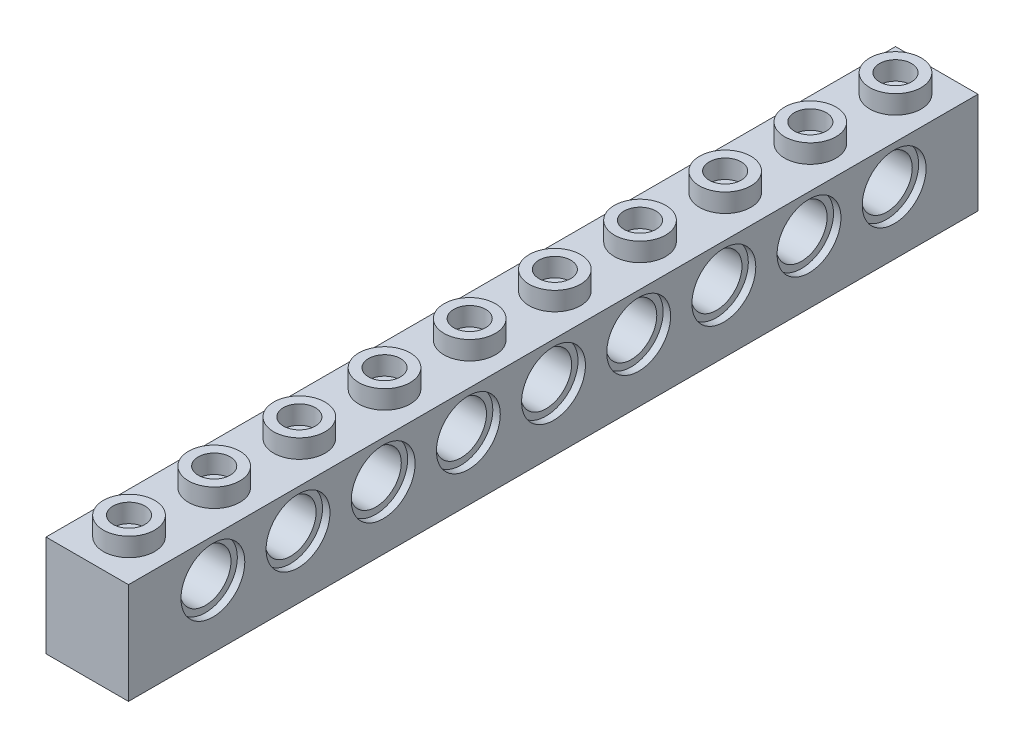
ISO-10303-21;
HEADER;
FILE_DESCRIPTION(('STEP AP214'),'2;1');
FILE_NAME('part.step','',(''),(''),'','','');
FILE_SCHEMA(('AUTOMOTIVE_DESIGN { 1 0 10303 214 1 1 1 1 }'));
ENDSEC;
DATA;
#1=APPLICATION_CONTEXT('core data for automotive mechanical design processes');
#2=APPLICATION_PROTOCOL_DEFINITION('international standard','automotive_design',2000,#1);
#3=PRODUCT_CONTEXT('',#1,'mechanical');
#4=PRODUCT('Part','Part','',(#3));
#5=PRODUCT_RELATED_PRODUCT_CATEGORY('part','',(#4));
#6=PRODUCT_DEFINITION_FORMATION('','',#4);
#7=PRODUCT_DEFINITION_CONTEXT('part definition',#1,'design');
#8=PRODUCT_DEFINITION('design','',#6,#7);
#9=PRODUCT_DEFINITION_SHAPE('','',#8);
#10=(LENGTH_UNIT() NAMED_UNIT(*) SI_UNIT(.MILLI.,.METRE.));
#11=(NAMED_UNIT(*) PLANE_ANGLE_UNIT() SI_UNIT($,.RADIAN.));
#12=(NAMED_UNIT(*) SI_UNIT($,.STERADIAN.) SOLID_ANGLE_UNIT());
#13=UNCERTAINTY_MEASURE_WITH_UNIT(LENGTH_MEASURE(1.E-05),#10,'distance_accuracy_value','');
#14=(GEOMETRIC_REPRESENTATION_CONTEXT(3) GLOBAL_UNCERTAINTY_ASSIGNED_CONTEXT((#13)) GLOBAL_UNIT_ASSIGNED_CONTEXT((#10,
#11,#12)) REPRESENTATION_CONTEXT('',''));
#15=CARTESIAN_POINT('',(0.,0.,0.));
#16=DIRECTION('',(0.,0.,1.));
#17=DIRECTION('',(1.,0.,0.));
#18=AXIS2_PLACEMENT_3D('',#15,#16,#17);
#19=CARTESIAN_POINT('',(-2.425,-3.,1.45));
#20=DIRECTION('',(0.,-1.,0.));
#21=DIRECTION('',(0.,0.,-1.));
#22=AXIS2_PLACEMENT_3D('',#19,#20,#21);
#23=PLANE('',#22);
#24=CARTESIAN_POINT('',(0.,-3.,16.2));
#25=DIRECTION('',(0.,-1.,0.));
#26=DIRECTION('',(0.,0.,-1.));
#27=AXIS2_PLACEMENT_3D('',#24,#25,#26);
#28=CIRCLE('',#27,1.5);
#29=CARTESIAN_POINT('',(0.,-3.,14.7));
#30=VERTEX_POINT('',#29);
#31=EDGE_CURVE('E462',#30,#30,#28,.T.);
#32=ORIENTED_EDGE('',*,*,#31,.F.);
#33=EDGE_LOOP('',(#32));
#34=FACE_BOUND('',#33,.T.);
#35=CARTESIAN_POINT('',(0.,-3.,32.2));
#36=DIRECTION('',(0.,-1.,0.));
#37=DIRECTION('',(0.,0.,-1.));
#38=AXIS2_PLACEMENT_3D('',#35,#36,#37);
#39=CIRCLE('',#38,1.5);
#40=CARTESIAN_POINT('',(0.,-3.,30.7));
#41=VERTEX_POINT('',#40);
#42=EDGE_CURVE('E474',#41,#41,#39,.T.);
#43=ORIENTED_EDGE('',*,*,#42,.F.);
#44=EDGE_LOOP('',(#43));
#45=FACE_BOUND('',#44,.T.);
#46=CARTESIAN_POINT('',(0.,-3.,48.2));
#47=DIRECTION('',(0.,-1.,0.));
#48=DIRECTION('',(0.,0.,-1.));
#49=AXIS2_PLACEMENT_3D('',#46,#47,#48);
#50=CIRCLE('',#49,1.5);
#51=CARTESIAN_POINT('',(0.,-3.,46.7));
#52=VERTEX_POINT('',#51);
#53=EDGE_CURVE('E486',#52,#52,#50,.T.);
#54=ORIENTED_EDGE('',*,*,#53,.F.);
#55=EDGE_LOOP('',(#54));
#56=FACE_BOUND('',#55,.T.);
#57=CARTESIAN_POINT('',(0.,-3.,64.2));
#58=DIRECTION('',(0.,-1.,0.));
#59=DIRECTION('',(0.,0.,-1.));
#60=AXIS2_PLACEMENT_3D('',#57,#58,#59);
#61=CIRCLE('',#60,1.5);
#62=CARTESIAN_POINT('',(0.,-3.,62.7));
#63=VERTEX_POINT('',#62);
#64=EDGE_CURVE('E498',#63,#63,#61,.T.);
#65=ORIENTED_EDGE('',*,*,#64,.F.);
#66=EDGE_LOOP('',(#65));
#67=FACE_BOUND('',#66,.T.);
#68=DIRECTION('',(0.,0.,-1.));
#69=VECTOR('',#68,1.);
#70=CARTESIAN_POINT('',(-2.425,-3.,78.35));
#71=LINE('',#70,#69);
#72=CARTESIAN_POINT('',(-2.425,-3.,78.35));
#73=VERTEX_POINT('',#72);
#74=CARTESIAN_POINT('',(-2.425,-3.,1.45));
#75=VERTEX_POINT('',#74);
#76=EDGE_CURVE('E116',#73,#75,#71,.T.);
#77=ORIENTED_EDGE('',*,*,#76,.T.);
#78=DIRECTION('',(1.,0.,0.));
#79=VECTOR('',#78,1.);
#80=CARTESIAN_POINT('',(-2.425,-3.,1.45));
#81=LINE('',#80,#79);
#82=CARTESIAN_POINT('',(2.425,-3.,1.45));
#83=VERTEX_POINT('',#82);
#84=EDGE_CURVE('E125',#75,#83,#81,.T.);
#85=ORIENTED_EDGE('',*,*,#84,.T.);
#86=DIRECTION('',(0.,0.,1.));
#87=VECTOR('',#86,1.);
#88=CARTESIAN_POINT('',(2.425,-3.,1.45));
#89=LINE('',#88,#87);
#90=CARTESIAN_POINT('',(2.425,-3.,78.35));
#91=VERTEX_POINT('',#90);
#92=EDGE_CURVE('E130',#83,#91,#89,.T.);
#93=ORIENTED_EDGE('',*,*,#92,.T.);
#94=DIRECTION('',(-1.,0.,0.));
#95=VECTOR('',#94,1.);
#96=CARTESIAN_POINT('',(2.425,-3.,78.35));
#97=LINE('',#96,#95);
#98=EDGE_CURVE('E122',#91,#73,#97,.T.);
#99=ORIENTED_EDGE('',*,*,#98,.T.);
#100=EDGE_LOOP('',(#77,#85,#93,#99));
#101=FACE_BOUND('',#100,.T.);
#102=CARTESIAN_POINT('',(0.,-3.,72.2));
#103=DIRECTION('',(0.,-1.,0.));
#104=DIRECTION('',(0.,0.,-1.));
#105=AXIS2_PLACEMENT_3D('',#102,#103,#104);
#106=CIRCLE('',#105,1.5);
#107=CARTESIAN_POINT('',(0.,-3.,70.7));
#108=VERTEX_POINT('',#107);
#109=EDGE_CURVE('E140',#108,#108,#106,.T.);
#110=ORIENTED_EDGE('',*,*,#109,.F.);
#111=EDGE_LOOP('',(#110));
#112=FACE_BOUND('',#111,.T.);
#113=CARTESIAN_POINT('',(0.,-3.,56.2));
#114=DIRECTION('',(0.,-1.,0.));
#115=DIRECTION('',(0.,0.,-1.));
#116=AXIS2_PLACEMENT_3D('',#113,#114,#115);
#117=CIRCLE('',#116,1.5);
#118=CARTESIAN_POINT('',(0.,-3.,54.7));
#119=VERTEX_POINT('',#118);
#120=EDGE_CURVE('E492',#119,#119,#117,.T.);
#121=ORIENTED_EDGE('',*,*,#120,.F.);
#122=EDGE_LOOP('',(#121));
#123=FACE_BOUND('',#122,.T.);
#124=CARTESIAN_POINT('',(0.,-3.,40.2));
#125=DIRECTION('',(0.,-1.,0.));
#126=DIRECTION('',(0.,0.,-1.));
#127=AXIS2_PLACEMENT_3D('',#124,#125,#126);
#128=CIRCLE('',#127,1.5);
#129=CARTESIAN_POINT('',(0.,-3.,38.7));
#130=VERTEX_POINT('',#129);
#131=EDGE_CURVE('E480',#130,#130,#128,.T.);
#132=ORIENTED_EDGE('',*,*,#131,.F.);
#133=EDGE_LOOP('',(#132));
#134=FACE_BOUND('',#133,.T.);
#135=CARTESIAN_POINT('',(0.,-3.,24.2));
#136=DIRECTION('',(0.,-1.,0.));
#137=DIRECTION('',(0.,0.,-1.));
#138=AXIS2_PLACEMENT_3D('',#135,#136,#137);
#139=CIRCLE('',#138,1.5);
#140=CARTESIAN_POINT('',(0.,-3.,22.7));
#141=VERTEX_POINT('',#140);
#142=EDGE_CURVE('E468',#141,#141,#139,.T.);
#143=ORIENTED_EDGE('',*,*,#142,.F.);
#144=EDGE_LOOP('',(#143));
#145=FACE_BOUND('',#144,.T.);
#146=CARTESIAN_POINT('',(0.,-3.,8.2));
#147=DIRECTION('',(0.,-1.,0.));
#148=DIRECTION('',(0.,0.,-1.));
#149=AXIS2_PLACEMENT_3D('',#146,#147,#148);
#150=CIRCLE('',#149,1.5);
#151=CARTESIAN_POINT('',(0.,-3.,6.7));
#152=VERTEX_POINT('',#151);
#153=EDGE_CURVE('E456',#152,#152,#150,.T.);
#154=ORIENTED_EDGE('',*,*,#153,.F.);
#155=EDGE_LOOP('',(#154));
#156=FACE_BOUND('',#155,.T.);
#157=ADVANCED_FACE('F37',(#34,#45,#56,#67,#101,#112,#123,#134,#145,#156),#23,.T.);
#158=CARTESIAN_POINT('',(3.875,4.75,79.8));
#159=DIRECTION('',(0.,-1.,0.));
#160=DIRECTION('',(1.,0.,0.));
#161=AXIS2_PLACEMENT_3D('',#158,#159,#160);
#162=PLANE('',#161);
#163=DIRECTION('',(-1.,0.,0.));
#164=VECTOR('',#163,1.);
#165=CARTESIAN_POINT('',(3.875,4.75,0.));
#166=LINE('',#165,#164);
#167=CARTESIAN_POINT('',(3.875,4.75,0.));
#168=VERTEX_POINT('',#167);
#169=CARTESIAN_POINT('',(-3.875,4.75,0.));
#170=VERTEX_POINT('',#169);
#171=EDGE_CURVE('E84',#168,#170,#166,.T.);
#172=ORIENTED_EDGE('',*,*,#171,.T.);
#173=DIRECTION('',(0.,0.,-1.));
#174=VECTOR('',#173,1.);
#175=CARTESIAN_POINT('',(-3.875,4.75,79.8));
#176=LINE('',#175,#174);
#177=CARTESIAN_POINT('',(-3.875,4.75,79.8));
#178=VERTEX_POINT('',#177);
#179=EDGE_CURVE('E253',#178,#170,#176,.T.);
#180=ORIENTED_EDGE('',*,*,#179,.F.);
#181=DIRECTION('',(-1.,0.,0.));
#182=VECTOR('',#181,1.);
#183=CARTESIAN_POINT('',(3.875,4.75,79.8));
#184=LINE('',#183,#182);
#185=CARTESIAN_POINT('',(3.875,4.75,79.8));
#186=VERTEX_POINT('',#185);
#187=EDGE_CURVE('E63',#186,#178,#184,.T.);
#188=ORIENTED_EDGE('',*,*,#187,.F.);
#189=DIRECTION('',(0.,0.,-1.));
#190=VECTOR('',#189,1.);
#191=CARTESIAN_POINT('',(3.875,4.75,79.8));
#192=LINE('',#191,#190);
#193=EDGE_CURVE('E262',#186,#168,#192,.T.);
#194=ORIENTED_EDGE('',*,*,#193,.T.);
#195=EDGE_LOOP('',(#172,#180,#188,#194));
#196=FACE_BOUND('',#195,.T.);
#197=CARTESIAN_POINT('',(0.,4.75,3.875));
#198=DIRECTION('',(0.,-1.,0.));
#199=DIRECTION('',(1.,0.,0.));
#200=AXIS2_PLACEMENT_3D('',#197,#198,#199);
#201=CIRCLE('',#200,2.415);
#202=CARTESIAN_POINT('',(2.415,4.75,3.875));
#203=VERTEX_POINT('',#202);
#204=EDGE_CURVE('E269',#203,#203,#201,.F.);
#205=ORIENTED_EDGE('',*,*,#204,.F.);
#206=EDGE_LOOP('',(#205));
#207=FACE_BOUND('',#206,.T.);
#208=CARTESIAN_POINT('',(0.,4.75,11.875));
#209=DIRECTION('',(0.,-1.,0.));
#210=DIRECTION('',(1.,0.,0.));
#211=AXIS2_PLACEMENT_3D('',#208,#209,#210);
#212=CIRCLE('',#211,2.415);
#213=CARTESIAN_POINT('',(2.415,4.75,11.875));
#214=VERTEX_POINT('',#213);
#215=EDGE_CURVE('E272',#214,#214,#212,.F.);
#216=ORIENTED_EDGE('',*,*,#215,.F.);
#217=EDGE_LOOP('',(#216));
#218=FACE_BOUND('',#217,.T.);
#219=CARTESIAN_POINT('',(0.,4.75,19.875));
#220=DIRECTION('',(0.,-1.,0.));
#221=DIRECTION('',(1.,0.,0.));
#222=AXIS2_PLACEMENT_3D('',#219,#220,#221);
#223=CIRCLE('',#222,2.415);
#224=CARTESIAN_POINT('',(2.415,4.75,19.875));
#225=VERTEX_POINT('',#224);
#226=EDGE_CURVE('E275',#225,#225,#223,.F.);
#227=ORIENTED_EDGE('',*,*,#226,.F.);
#228=EDGE_LOOP('',(#227));
#229=FACE_BOUND('',#228,.T.);
#230=CARTESIAN_POINT('',(0.,4.75,27.875));
#231=DIRECTION('',(0.,-1.,0.));
#232=DIRECTION('',(1.,0.,0.));
#233=AXIS2_PLACEMENT_3D('',#230,#231,#232);
#234=CIRCLE('',#233,2.415);
#235=CARTESIAN_POINT('',(2.415,4.75,27.875));
#236=VERTEX_POINT('',#235);
#237=EDGE_CURVE('E278',#236,#236,#234,.F.);
#238=ORIENTED_EDGE('',*,*,#237,.F.);
#239=EDGE_LOOP('',(#238));
#240=FACE_BOUND('',#239,.T.);
#241=CARTESIAN_POINT('',(0.,4.75,35.875));
#242=DIRECTION('',(0.,-1.,0.));
#243=DIRECTION('',(1.,0.,0.));
#244=AXIS2_PLACEMENT_3D('',#241,#242,#243);
#245=CIRCLE('',#244,2.415);
#246=CARTESIAN_POINT('',(2.415,4.75,35.875));
#247=VERTEX_POINT('',#246);
#248=EDGE_CURVE('E281',#247,#247,#245,.F.);
#249=ORIENTED_EDGE('',*,*,#248,.F.);
#250=EDGE_LOOP('',(#249));
#251=FACE_BOUND('',#250,.T.);
#252=CARTESIAN_POINT('',(0.,4.75,43.875));
#253=DIRECTION('',(0.,-1.,0.));
#254=DIRECTION('',(1.,0.,0.));
#255=AXIS2_PLACEMENT_3D('',#252,#253,#254);
#256=CIRCLE('',#255,2.415);
#257=CARTESIAN_POINT('',(2.415,4.75,43.875));
#258=VERTEX_POINT('',#257);
#259=EDGE_CURVE('E284',#258,#258,#256,.F.);
#260=ORIENTED_EDGE('',*,*,#259,.F.);
#261=EDGE_LOOP('',(#260));
#262=FACE_BOUND('',#261,.T.);
#263=CARTESIAN_POINT('',(0.,4.75,51.875));
#264=DIRECTION('',(0.,-1.,0.));
#265=DIRECTION('',(1.,0.,0.));
#266=AXIS2_PLACEMENT_3D('',#263,#264,#265);
#267=CIRCLE('',#266,2.415);
#268=CARTESIAN_POINT('',(2.415,4.75,51.875));
#269=VERTEX_POINT('',#268);
#270=EDGE_CURVE('E287',#269,#269,#267,.F.);
#271=ORIENTED_EDGE('',*,*,#270,.F.);
#272=EDGE_LOOP('',(#271));
#273=FACE_BOUND('',#272,.T.);
#274=CARTESIAN_POINT('',(0.,4.75,59.875));
#275=DIRECTION('',(0.,-1.,0.));
#276=DIRECTION('',(1.,0.,0.));
#277=AXIS2_PLACEMENT_3D('',#274,#275,#276);
#278=CIRCLE('',#277,2.415);
#279=CARTESIAN_POINT('',(2.415,4.75,59.875));
#280=VERTEX_POINT('',#279);
#281=EDGE_CURVE('E290',#280,#280,#278,.F.);
#282=ORIENTED_EDGE('',*,*,#281,.F.);
#283=EDGE_LOOP('',(#282));
#284=FACE_BOUND('',#283,.T.);
#285=CARTESIAN_POINT('',(0.,4.75,67.875));
#286=DIRECTION('',(0.,-1.,0.));
#287=DIRECTION('',(1.,0.,0.));
#288=AXIS2_PLACEMENT_3D('',#285,#286,#287);
#289=CIRCLE('',#288,2.415);
#290=CARTESIAN_POINT('',(2.415,4.75,67.875));
#291=VERTEX_POINT('',#290);
#292=EDGE_CURVE('E293',#291,#291,#289,.F.);
#293=ORIENTED_EDGE('',*,*,#292,.F.);
#294=EDGE_LOOP('',(#293));
#295=FACE_BOUND('',#294,.T.);
#296=CARTESIAN_POINT('',(0.,4.75,75.875));
#297=DIRECTION('',(0.,-1.,0.));
#298=DIRECTION('',(1.,0.,0.));
#299=AXIS2_PLACEMENT_3D('',#296,#297,#298);
#300=CIRCLE('',#299,2.415);
#301=CARTESIAN_POINT('',(2.415,4.75,75.875));
#302=VERTEX_POINT('',#301);
#303=EDGE_CURVE('E296',#302,#302,#300,.F.);
#304=ORIENTED_EDGE('',*,*,#303,.F.);
#305=EDGE_LOOP('',(#304));
#306=FACE_BOUND('',#305,.T.);
#307=ADVANCED_FACE('F514',(#196,#207,#218,#229,#240,#251,#262,#273,#284,#295,#306),#162,.F.);
#308=CARTESIAN_POINT('',(-3.875,-4.75,79.8));
#309=DIRECTION('',(1.,0.,0.));
#310=DIRECTION('',(0.,0.,-1.));
#311=AXIS2_PLACEMENT_3D('',#308,#309,#310);
#312=PLANE('',#311);
#313=CARTESIAN_POINT('',(-3.875,1.15,63.875));
#314=DIRECTION('',(-1.,0.,0.));
#315=DIRECTION('',(0.,0.,1.));
#316=AXIS2_PLACEMENT_3D('',#313,#314,#315);
#317=CIRCLE('',#316,3.00000000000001);
#318=CARTESIAN_POINT('',(-3.875,1.15,66.875));
#319=VERTEX_POINT('',#318);
#320=EDGE_CURVE('E437',#319,#319,#317,.T.);
#321=ORIENTED_EDGE('',*,*,#320,.F.);
#322=EDGE_LOOP('',(#321));
#323=FACE_BOUND('',#322,.T.);
#324=CARTESIAN_POINT('',(-3.875,1.15,71.875));
#325=DIRECTION('',(-1.,0.,0.));
#326=DIRECTION('',(0.,0.,1.));
#327=AXIS2_PLACEMENT_3D('',#324,#325,#326);
#328=CIRCLE('',#327,3.00000000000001);
#329=CARTESIAN_POINT('',(-3.875,1.15,74.875));
#330=VERTEX_POINT('',#329);
#331=EDGE_CURVE('E450',#330,#330,#328,.T.);
#332=ORIENTED_EDGE('',*,*,#331,.F.);
#333=EDGE_LOOP('',(#332));
#334=FACE_BOUND('',#333,.T.);
#335=DIRECTION('',(0.,-1.,0.));
#336=VECTOR('',#335,1.);
#337=CARTESIAN_POINT('',(-3.875,-4.75,0.));
#338=LINE('',#337,#336);
#339=CARTESIAN_POINT('',(-3.875,-4.75,0.));
#340=VERTEX_POINT('',#339);
#341=EDGE_CURVE('E246',#170,#340,#338,.T.);
#342=ORIENTED_EDGE('',*,*,#341,.T.);
#343=DIRECTION('',(0.,0.,-1.));
#344=VECTOR('',#343,1.);
#345=CARTESIAN_POINT('',(-3.875,-4.75,79.8));
#346=LINE('',#345,#344);
#347=CARTESIAN_POINT('',(-3.875,-4.75,79.8));
#348=VERTEX_POINT('',#347);
#349=EDGE_CURVE('E267',#348,#340,#346,.T.);
#350=ORIENTED_EDGE('',*,*,#349,.F.);
#351=DIRECTION('',(0.,-1.,0.));
#352=VECTOR('',#351,1.);
#353=CARTESIAN_POINT('',(-3.875,-4.75,79.8));
#354=LINE('',#353,#352);
#355=EDGE_CURVE('E247',#178,#348,#354,.T.);
#356=ORIENTED_EDGE('',*,*,#355,.F.);
#357=ORIENTED_EDGE('',*,*,#179,.T.);
#358=EDGE_LOOP('',(#342,#350,#356,#357));
#359=FACE_BOUND('',#358,.T.);
#360=CARTESIAN_POINT('',(-3.875,1.15,55.875));
#361=DIRECTION('',(-1.,0.,0.));
#362=DIRECTION('',(0.,0.,1.));
#363=AXIS2_PLACEMENT_3D('',#360,#361,#362);
#364=CIRCLE('',#363,3.00000000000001);
#365=CARTESIAN_POINT('',(-3.875,1.15,58.875));
#366=VERTEX_POINT('',#365);
#367=EDGE_CURVE('E299',#366,#366,#364,.T.);
#368=ORIENTED_EDGE('',*,*,#367,.F.);
#369=EDGE_LOOP('',(#368));
#370=FACE_BOUND('',#369,.T.);
#371=CARTESIAN_POINT('',(-3.875,1.15,47.875));
#372=DIRECTION('',(-1.,0.,0.));
#373=DIRECTION('',(0.,0.,1.));
#374=AXIS2_PLACEMENT_3D('',#371,#372,#373);
#375=CIRCLE('',#374,3.00000000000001);
#376=CARTESIAN_POINT('',(-3.875,1.15,50.875));
#377=VERTEX_POINT('',#376);
#378=EDGE_CURVE('E310',#377,#377,#375,.T.);
#379=ORIENTED_EDGE('',*,*,#378,.F.);
#380=EDGE_LOOP('',(#379));
#381=FACE_BOUND('',#380,.T.);
#382=CARTESIAN_POINT('',(-3.875,1.15,39.875));
#383=DIRECTION('',(-1.,0.,0.));
#384=DIRECTION('',(0.,0.,1.));
#385=AXIS2_PLACEMENT_3D('',#382,#383,#384);
#386=CIRCLE('',#385,3.00000000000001);
#387=CARTESIAN_POINT('',(-3.875,1.15,42.875));
#388=VERTEX_POINT('',#387);
#389=EDGE_CURVE('E316',#388,#388,#386,.T.);
#390=ORIENTED_EDGE('',*,*,#389,.F.);
#391=EDGE_LOOP('',(#390));
#392=FACE_BOUND('',#391,.T.);
#393=CARTESIAN_POINT('',(-3.875,1.15,31.875));
#394=DIRECTION('',(-1.,0.,0.));
#395=DIRECTION('',(0.,0.,1.));
#396=AXIS2_PLACEMENT_3D('',#393,#394,#395);
#397=CIRCLE('',#396,3.00000000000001);
#398=CARTESIAN_POINT('',(-3.875,1.15,34.875));
#399=VERTEX_POINT('',#398);
#400=EDGE_CURVE('E322',#399,#399,#397,.T.);
#401=ORIENTED_EDGE('',*,*,#400,.F.);
#402=EDGE_LOOP('',(#401));
#403=FACE_BOUND('',#402,.T.);
#404=CARTESIAN_POINT('',(-3.875,1.15,23.875));
#405=DIRECTION('',(-1.,0.,0.));
#406=DIRECTION('',(0.,0.,1.));
#407=AXIS2_PLACEMENT_3D('',#404,#405,#406);
#408=CIRCLE('',#407,3.00000000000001);
#409=CARTESIAN_POINT('',(-3.875,1.15,26.875));
#410=VERTEX_POINT('',#409);
#411=EDGE_CURVE('E328',#410,#410,#408,.T.);
#412=ORIENTED_EDGE('',*,*,#411,.F.);
#413=EDGE_LOOP('',(#412));
#414=FACE_BOUND('',#413,.T.);
#415=CARTESIAN_POINT('',(-3.875,1.15,15.875));
#416=DIRECTION('',(-1.,0.,0.));
#417=DIRECTION('',(0.,0.,1.));
#418=AXIS2_PLACEMENT_3D('',#415,#416,#417);
#419=CIRCLE('',#418,3.00000000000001);
#420=CARTESIAN_POINT('',(-3.875,1.15,18.875));
#421=VERTEX_POINT('',#420);
#422=EDGE_CURVE('E334',#421,#421,#419,.T.);
#423=ORIENTED_EDGE('',*,*,#422,.F.);
#424=EDGE_LOOP('',(#423));
#425=FACE_BOUND('',#424,.T.);
#426=CARTESIAN_POINT('',(-3.875,1.15,7.87500000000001));
#427=DIRECTION('',(-1.,0.,0.));
#428=DIRECTION('',(0.,0.,1.));
#429=AXIS2_PLACEMENT_3D('',#426,#427,#428);
#430=CIRCLE('',#429,3.00000000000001);
#431=CARTESIAN_POINT('',(-3.875,1.15,10.875));
#432=VERTEX_POINT('',#431);
#433=EDGE_CURVE('E46',#432,#432,#430,.T.);
#434=ORIENTED_EDGE('',*,*,#433,.F.);
#435=EDGE_LOOP('',(#434));
#436=FACE_BOUND('',#435,.T.);
#437=ADVANCED_FACE('F760',(#323,#334,#359,#370,#381,#392,#403,#414,#425,#436),#312,.F.);
#438=CARTESIAN_POINT('',(3.875,-4.75,79.8));
#439=DIRECTION('',(0.,1.,0.));
#440=DIRECTION('',(0.,0.,1.));
#441=AXIS2_PLACEMENT_3D('',#438,#439,#440);
#442=PLANE('',#441);
#443=DIRECTION('',(1.,0.,0.));
#444=VECTOR('',#443,1.);
#445=CARTESIAN_POINT('',(-2.425,-4.75,1.45));
#446=LINE('',#445,#444);
#447=CARTESIAN_POINT('',(-2.425,-4.75,1.44999999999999));
#448=VERTEX_POINT('',#447);
#449=CARTESIAN_POINT('',(2.425,-4.75,1.45));
#450=VERTEX_POINT('',#449);
#451=EDGE_CURVE('E146',#448,#450,#446,.T.);
#452=ORIENTED_EDGE('',*,*,#451,.F.);
#453=DIRECTION('',(0.,0.,-1.));
#454=VECTOR('',#453,1.);
#455=CARTESIAN_POINT('',(-2.425,-4.75,78.35));
#456=LINE('',#455,#454);
#457=CARTESIAN_POINT('',(-2.425,-4.75,78.35));
#458=VERTEX_POINT('',#457);
#459=EDGE_CURVE('E54',#458,#448,#456,.T.);
#460=ORIENTED_EDGE('',*,*,#459,.F.);
#461=DIRECTION('',(-1.,0.,0.));
#462=VECTOR('',#461,1.);
#463=CARTESIAN_POINT('',(2.425,-4.75,78.35));
#464=LINE('',#463,#462);
#465=CARTESIAN_POINT('',(2.425,-4.75,78.35));
#466=VERTEX_POINT('',#465);
#467=EDGE_CURVE('E134',#466,#458,#464,.T.);
#468=ORIENTED_EDGE('',*,*,#467,.F.);
#469=DIRECTION('',(0.,0.,1.));
#470=VECTOR('',#469,1.);
#471=CARTESIAN_POINT('',(2.425,-4.75,1.45));
#472=LINE('',#471,#470);
#473=EDGE_CURVE('E137',#450,#466,#472,.T.);
#474=ORIENTED_EDGE('',*,*,#473,.F.);
#475=EDGE_LOOP('',(#452,#460,#468,#474));
#476=FACE_BOUND('',#475,.T.);
#477=DIRECTION('',(1.,0.,0.));
#478=VECTOR('',#477,1.);
#479=CARTESIAN_POINT('',(3.875,-4.75,0.));
#480=LINE('',#479,#478);
#481=CARTESIAN_POINT('',(3.875,-4.75,0.));
#482=VERTEX_POINT('',#481);
#483=EDGE_CURVE('E256',#340,#482,#480,.T.);
#484=ORIENTED_EDGE('',*,*,#483,.T.);
#485=DIRECTION('',(0.,0.,-1.));
#486=VECTOR('',#485,1.);
#487=CARTESIAN_POINT('',(3.875,-4.75,79.8));
#488=LINE('',#487,#486);
#489=CARTESIAN_POINT('',(3.875,-4.75,79.8));
#490=VERTEX_POINT('',#489);
#491=EDGE_CURVE('E264',#490,#482,#488,.T.);
#492=ORIENTED_EDGE('',*,*,#491,.F.);
#493=DIRECTION('',(1.,0.,0.));
#494=VECTOR('',#493,1.);
#495=CARTESIAN_POINT('',(3.875,-4.75,79.8));
#496=LINE('',#495,#494);
#497=EDGE_CURVE('E92',#348,#490,#496,.T.);
#498=ORIENTED_EDGE('',*,*,#497,.F.);
#499=ORIENTED_EDGE('',*,*,#349,.T.);
#500=EDGE_LOOP('',(#484,#492,#498,#499));
#501=FACE_BOUND('',#500,.T.);
#502=ADVANCED_FACE('F756',(#476,#501),#442,.F.);
#503=CARTESIAN_POINT('',(3.875,-4.75,79.8));
#504=DIRECTION('',(-1.,0.,0.));
#505=DIRECTION('',(0.,0.,1.));
#506=AXIS2_PLACEMENT_3D('',#503,#504,#505);
#507=PLANE('',#506);
#508=CARTESIAN_POINT('',(3.875,1.15,7.87500000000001));
#509=DIRECTION('',(1.,0.,0.));
#510=DIRECTION('',(0.,0.,-1.));
#511=AXIS2_PLACEMENT_3D('',#508,#509,#510);
#512=CIRCLE('',#511,3.00000000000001);
#513=CARTESIAN_POINT('',(3.875,1.15,4.875));
#514=VERTEX_POINT('',#513);
#515=EDGE_CURVE('E391',#514,#514,#512,.T.);
#516=ORIENTED_EDGE('',*,*,#515,.F.);
#517=EDGE_LOOP('',(#516));
#518=FACE_BOUND('',#517,.T.);
#519=CARTESIAN_POINT('',(3.875,1.15,15.875));
#520=DIRECTION('',(1.,0.,0.));
#521=DIRECTION('',(0.,0.,-1.));
#522=AXIS2_PLACEMENT_3D('',#519,#520,#521);
#523=CIRCLE('',#522,3.00000000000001);
#524=CARTESIAN_POINT('',(3.875,1.15,12.875));
#525=VERTEX_POINT('',#524);
#526=EDGE_CURVE('E395',#525,#525,#523,.T.);
#527=ORIENTED_EDGE('',*,*,#526,.F.);
#528=EDGE_LOOP('',(#527));
#529=FACE_BOUND('',#528,.T.);
#530=CARTESIAN_POINT('',(3.875,1.15,23.875));
#531=DIRECTION('',(1.,0.,0.));
#532=DIRECTION('',(0.,0.,-1.));
#533=AXIS2_PLACEMENT_3D('',#530,#531,#532);
#534=CIRCLE('',#533,3.00000000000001);
#535=CARTESIAN_POINT('',(3.875,1.15,20.875));
#536=VERTEX_POINT('',#535);
#537=EDGE_CURVE('E401',#536,#536,#534,.T.);
#538=ORIENTED_EDGE('',*,*,#537,.F.);
#539=EDGE_LOOP('',(#538));
#540=FACE_BOUND('',#539,.T.);
#541=CARTESIAN_POINT('',(3.875,1.15,31.875));
#542=DIRECTION('',(1.,0.,0.));
#543=DIRECTION('',(0.,0.,-1.));
#544=AXIS2_PLACEMENT_3D('',#541,#542,#543);
#545=CIRCLE('',#544,3.00000000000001);
#546=CARTESIAN_POINT('',(3.875,1.15,28.875));
#547=VERTEX_POINT('',#546);
#548=EDGE_CURVE('E407',#547,#547,#545,.T.);
#549=ORIENTED_EDGE('',*,*,#548,.F.);
#550=EDGE_LOOP('',(#549));
#551=FACE_BOUND('',#550,.T.);
#552=CARTESIAN_POINT('',(3.875,1.15,39.875));
#553=DIRECTION('',(1.,0.,0.));
#554=DIRECTION('',(0.,0.,-1.));
#555=AXIS2_PLACEMENT_3D('',#552,#553,#554);
#556=CIRCLE('',#555,3.00000000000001);
#557=CARTESIAN_POINT('',(3.875,1.15,36.875));
#558=VERTEX_POINT('',#557);
#559=EDGE_CURVE('E413',#558,#558,#556,.T.);
#560=ORIENTED_EDGE('',*,*,#559,.F.);
#561=EDGE_LOOP('',(#560));
#562=FACE_BOUND('',#561,.T.);
#563=CARTESIAN_POINT('',(3.875,1.15,47.875));
#564=DIRECTION('',(1.,0.,0.));
#565=DIRECTION('',(0.,0.,-1.));
#566=AXIS2_PLACEMENT_3D('',#563,#564,#565);
#567=CIRCLE('',#566,3.00000000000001);
#568=CARTESIAN_POINT('',(3.875,1.15,44.875));
#569=VERTEX_POINT('',#568);
#570=EDGE_CURVE('E419',#569,#569,#567,.T.);
#571=ORIENTED_EDGE('',*,*,#570,.F.);
#572=EDGE_LOOP('',(#571));
#573=FACE_BOUND('',#572,.T.);
#574=CARTESIAN_POINT('',(3.875,1.15,55.875));
#575=DIRECTION('',(1.,0.,0.));
#576=DIRECTION('',(0.,0.,-1.));
#577=AXIS2_PLACEMENT_3D('',#574,#575,#576);
#578=CIRCLE('',#577,3.00000000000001);
#579=CARTESIAN_POINT('',(3.875,1.15,52.875));
#580=VERTEX_POINT('',#579);
#581=EDGE_CURVE('E425',#580,#580,#578,.T.);
#582=ORIENTED_EDGE('',*,*,#581,.F.);
#583=EDGE_LOOP('',(#582));
#584=FACE_BOUND('',#583,.T.);
#585=CARTESIAN_POINT('',(3.875,1.15,63.875));
#586=DIRECTION('',(1.,0.,0.));
#587=DIRECTION('',(0.,0.,-1.));
#588=AXIS2_PLACEMENT_3D('',#585,#586,#587);
#589=CIRCLE('',#588,3.00000000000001);
#590=CARTESIAN_POINT('',(3.875,1.15,60.875));
#591=VERTEX_POINT('',#590);
#592=EDGE_CURVE('E431',#591,#591,#589,.T.);
#593=ORIENTED_EDGE('',*,*,#592,.F.);
#594=EDGE_LOOP('',(#593));
#595=FACE_BOUND('',#594,.T.);
#596=CARTESIAN_POINT('',(3.875,1.15,71.875));
#597=DIRECTION('',(1.,0.,0.));
#598=DIRECTION('',(0.,0.,-1.));
#599=AXIS2_PLACEMENT_3D('',#596,#597,#598);
#600=CIRCLE('',#599,3.00000000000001);
#601=CARTESIAN_POINT('',(3.875,1.15,68.875));
#602=VERTEX_POINT('',#601);
#603=EDGE_CURVE('E446',#602,#602,#600,.T.);
#604=ORIENTED_EDGE('',*,*,#603,.F.);
#605=EDGE_LOOP('',(#604));
#606=FACE_BOUND('',#605,.T.);
#607=DIRECTION('',(0.,1.,0.));
#608=VECTOR('',#607,1.);
#609=CARTESIAN_POINT('',(3.875,-4.75,0.));
#610=LINE('',#609,#608);
#611=EDGE_CURVE('E258',#482,#168,#610,.T.);
#612=ORIENTED_EDGE('',*,*,#611,.T.);
#613=ORIENTED_EDGE('',*,*,#193,.F.);
#614=DIRECTION('',(0.,1.,0.));
#615=VECTOR('',#614,1.);
#616=CARTESIAN_POINT('',(3.875,-4.75,79.8));
#617=LINE('',#616,#615);
#618=EDGE_CURVE('E250',#490,#186,#617,.T.);
#619=ORIENTED_EDGE('',*,*,#618,.F.);
#620=ORIENTED_EDGE('',*,*,#491,.T.);
#621=EDGE_LOOP('',(#612,#613,#619,#620));
#622=FACE_BOUND('',#621,.T.);
#623=ADVANCED_FACE('F747',(#518,#529,#540,#551,#562,#573,#584,#595,#606,#622),#507,.F.);
#624=CARTESIAN_POINT('',(-3.875,4.75,79.8));
#625=DIRECTION('',(0.,0.,1.));
#626=DIRECTION('',(1.,0.,0.));
#627=AXIS2_PLACEMENT_3D('',#624,#625,#626);
#628=PLANE('',#627);
#629=ORIENTED_EDGE('',*,*,#355,.T.);
#630=ORIENTED_EDGE('',*,*,#497,.T.);
#631=ORIENTED_EDGE('',*,*,#618,.T.);
#632=ORIENTED_EDGE('',*,*,#187,.T.);
#633=EDGE_LOOP('',(#629,#630,#631,#632));
#634=FACE_BOUND('',#633,.T.);
#635=ADVANCED_FACE('F744',(#634),#628,.T.);
#636=CARTESIAN_POINT('',(-3.875,4.75,0.));
#637=DIRECTION('',(0.,0.,1.));
#638=DIRECTION('',(1.,0.,0.));
#639=AXIS2_PLACEMENT_3D('',#636,#637,#638);
#640=PLANE('',#639);
#641=ORIENTED_EDGE('',*,*,#341,.F.);
#642=ORIENTED_EDGE('',*,*,#171,.F.);
#643=ORIENTED_EDGE('',*,*,#611,.F.);
#644=ORIENTED_EDGE('',*,*,#483,.F.);
#645=EDGE_LOOP('',(#641,#642,#643,#644));
#646=FACE_BOUND('',#645,.T.);
#647=ADVANCED_FACE('F739',(#646),#640,.F.);
#648=CARTESIAN_POINT('',(0.,6.5,3.875));
#649=DIRECTION('',(0.,1.,0.));
#650=DIRECTION('',(-1.,0.,0.));
#651=AXIS2_PLACEMENT_3D('',#648,#649,#650);
#652=PLANE('',#651);
#653=CARTESIAN_POINT('',(0.,6.5,3.875));
#654=DIRECTION('',(0.,1.,0.));
#655=DIRECTION('',(-1.,0.,0.));
#656=AXIS2_PLACEMENT_3D('',#653,#654,#655);
#657=CIRCLE('',#656,2.415);
#658=CARTESIAN_POINT('',(-2.415,6.5,3.875));
#659=VERTEX_POINT('',#658);
#660=EDGE_CURVE('E241',#659,#659,#657,.T.);
#661=ORIENTED_EDGE('',*,*,#660,.T.);
#662=EDGE_LOOP('',(#661));
#663=FACE_BOUND('',#662,.T.);
#664=CARTESIAN_POINT('',(0.,6.5,3.875));
#665=DIRECTION('',(0.,1.,0.));
#666=DIRECTION('',(-1.,0.,0.));
#667=AXIS2_PLACEMENT_3D('',#664,#665,#666);
#668=CIRCLE('',#667,1.5);
#669=CARTESIAN_POINT('',(-1.5,6.5,3.875));
#670=VERTEX_POINT('',#669);
#671=EDGE_CURVE('E238',#670,#670,#668,.T.);
#672=ORIENTED_EDGE('',*,*,#671,.F.);
#673=EDGE_LOOP('',(#672));
#674=FACE_BOUND('',#673,.T.);
#675=ADVANCED_FACE('F736',(#663,#674),#652,.T.);
#676=CARTESIAN_POINT('',(0.,6.5,3.875));
#677=DIRECTION('',(0.,-1.,0.));
#678=DIRECTION('',(1.,0.,0.));
#679=AXIS2_PLACEMENT_3D('',#676,#677,#678);
#680=CYLINDRICAL_SURFACE('',#679,2.415);
#681=ORIENTED_EDGE('',*,*,#660,.F.);
#682=EDGE_LOOP('',(#681));
#683=FACE_BOUND('',#682,.T.);
#684=ORIENTED_EDGE('',*,*,#204,.T.);
#685=EDGE_LOOP('',(#684));
#686=FACE_BOUND('',#685,.T.);
#687=ADVANCED_FACE('F734',(#683,#686),#680,.T.);
#688=CARTESIAN_POINT('',(0.,6.5,3.875));
#689=DIRECTION('',(0.,-1.,0.));
#690=DIRECTION('',(1.,0.,0.));
#691=AXIS2_PLACEMENT_3D('',#688,#689,#690);
#692=CYLINDRICAL_SURFACE('',#691,1.5);
#693=ORIENTED_EDGE('',*,*,#671,.T.);
#694=EDGE_LOOP('',(#693));
#695=FACE_BOUND('',#694,.T.);
#696=CARTESIAN_POINT('',(0.,4.75,3.875));
#697=DIRECTION('',(0.,1.,0.));
#698=DIRECTION('',(-1.,0.,0.));
#699=AXIS2_PLACEMENT_3D('',#696,#697,#698);
#700=CIRCLE('',#699,1.5);
#701=CARTESIAN_POINT('',(-1.5,4.75,3.875));
#702=VERTEX_POINT('',#701);
#703=EDGE_CURVE('E237',#702,#702,#700,.T.);
#704=ORIENTED_EDGE('',*,*,#703,.F.);
#705=EDGE_LOOP('',(#704));
#706=FACE_BOUND('',#705,.T.);
#707=ADVANCED_FACE('F731',(#695,#706),#692,.F.);
#708=ORIENTED_EDGE('',*,*,#703,.T.);
#709=EDGE_LOOP('',(#708));
#710=FACE_BOUND('',#709,.T.);
#711=ADVANCED_FACE('F726',(#710),#162,.F.);
#712=CARTESIAN_POINT('',(0.,6.5,11.875));
#713=DIRECTION('',(0.,1.,0.));
#714=DIRECTION('',(-1.,0.,0.));
#715=AXIS2_PLACEMENT_3D('',#712,#713,#714);
#716=PLANE('',#715);
#717=CARTESIAN_POINT('',(0.,6.5,11.875));
#718=DIRECTION('',(0.,1.,0.));
#719=DIRECTION('',(-1.,0.,0.));
#720=AXIS2_PLACEMENT_3D('',#717,#718,#719);
#721=CIRCLE('',#720,2.415);
#722=CARTESIAN_POINT('',(-2.415,6.5,11.875));
#723=VERTEX_POINT('',#722);
#724=EDGE_CURVE('E232',#723,#723,#721,.T.);
#725=ORIENTED_EDGE('',*,*,#724,.T.);
#726=EDGE_LOOP('',(#725));
#727=FACE_BOUND('',#726,.T.);
#728=CARTESIAN_POINT('',(0.,6.5,11.875));
#729=DIRECTION('',(0.,1.,0.));
#730=DIRECTION('',(-1.,0.,0.));
#731=AXIS2_PLACEMENT_3D('',#728,#729,#730);
#732=CIRCLE('',#731,1.5);
#733=CARTESIAN_POINT('',(-1.5,6.5,11.875));
#734=VERTEX_POINT('',#733);
#735=EDGE_CURVE('E229',#734,#734,#732,.T.);
#736=ORIENTED_EDGE('',*,*,#735,.F.);
#737=EDGE_LOOP('',(#736));
#738=FACE_BOUND('',#737,.T.);
#739=ADVANCED_FACE('F723',(#727,#738),#716,.T.);
#740=CARTESIAN_POINT('',(0.,6.5,11.875));
#741=DIRECTION('',(0.,-1.,0.));
#742=DIRECTION('',(1.,0.,0.));
#743=AXIS2_PLACEMENT_3D('',#740,#741,#742);
#744=CYLINDRICAL_SURFACE('',#743,2.415);
#745=ORIENTED_EDGE('',*,*,#724,.F.);
#746=EDGE_LOOP('',(#745));
#747=FACE_BOUND('',#746,.T.);
#748=ORIENTED_EDGE('',*,*,#215,.T.);
#749=EDGE_LOOP('',(#748));
#750=FACE_BOUND('',#749,.T.);
#751=ADVANCED_FACE('F721',(#747,#750),#744,.T.);
#752=CARTESIAN_POINT('',(0.,6.5,11.875));
#753=DIRECTION('',(0.,-1.,0.));
#754=DIRECTION('',(1.,0.,0.));
#755=AXIS2_PLACEMENT_3D('',#752,#753,#754);
#756=CYLINDRICAL_SURFACE('',#755,1.5);
#757=ORIENTED_EDGE('',*,*,#735,.T.);
#758=EDGE_LOOP('',(#757));
#759=FACE_BOUND('',#758,.T.);
#760=CARTESIAN_POINT('',(0.,4.75,11.875));
#761=DIRECTION('',(0.,1.,0.));
#762=DIRECTION('',(-1.,0.,0.));
#763=AXIS2_PLACEMENT_3D('',#760,#761,#762);
#764=CIRCLE('',#763,1.5);
#765=CARTESIAN_POINT('',(-1.5,4.75,11.875));
#766=VERTEX_POINT('',#765);
#767=EDGE_CURVE('E228',#766,#766,#764,.T.);
#768=ORIENTED_EDGE('',*,*,#767,.F.);
#769=EDGE_LOOP('',(#768));
#770=FACE_BOUND('',#769,.T.);
#771=ADVANCED_FACE('F718',(#759,#770),#756,.F.);
#772=ORIENTED_EDGE('',*,*,#767,.T.);
#773=EDGE_LOOP('',(#772));
#774=FACE_BOUND('',#773,.T.);
#775=ADVANCED_FACE('F713',(#774),#162,.F.);
#776=CARTESIAN_POINT('',(0.,6.5,19.875));
#777=DIRECTION('',(0.,1.,0.));
#778=DIRECTION('',(-1.,0.,0.));
#779=AXIS2_PLACEMENT_3D('',#776,#777,#778);
#780=PLANE('',#779);
#781=CARTESIAN_POINT('',(0.,6.5,19.875));
#782=DIRECTION('',(0.,1.,0.));
#783=DIRECTION('',(-1.,0.,0.));
#784=AXIS2_PLACEMENT_3D('',#781,#782,#783);
#785=CIRCLE('',#784,2.415);
#786=CARTESIAN_POINT('',(-2.415,6.5,19.875));
#787=VERTEX_POINT('',#786);
#788=EDGE_CURVE('E223',#787,#787,#785,.T.);
#789=ORIENTED_EDGE('',*,*,#788,.T.);
#790=EDGE_LOOP('',(#789));
#791=FACE_BOUND('',#790,.T.);
#792=CARTESIAN_POINT('',(0.,6.5,19.875));
#793=DIRECTION('',(0.,1.,0.));
#794=DIRECTION('',(-1.,0.,0.));
#795=AXIS2_PLACEMENT_3D('',#792,#793,#794);
#796=CIRCLE('',#795,1.5);
#797=CARTESIAN_POINT('',(-1.5,6.5,19.875));
#798=VERTEX_POINT('',#797);
#799=EDGE_CURVE('E220',#798,#798,#796,.T.);
#800=ORIENTED_EDGE('',*,*,#799,.F.);
#801=EDGE_LOOP('',(#800));
#802=FACE_BOUND('',#801,.T.);
#803=ADVANCED_FACE('F710',(#791,#802),#780,.T.);
#804=CARTESIAN_POINT('',(0.,6.5,19.875));
#805=DIRECTION('',(0.,-1.,0.));
#806=DIRECTION('',(1.,0.,0.));
#807=AXIS2_PLACEMENT_3D('',#804,#805,#806);
#808=CYLINDRICAL_SURFACE('',#807,2.415);
#809=ORIENTED_EDGE('',*,*,#788,.F.);
#810=EDGE_LOOP('',(#809));
#811=FACE_BOUND('',#810,.T.);
#812=ORIENTED_EDGE('',*,*,#226,.T.);
#813=EDGE_LOOP('',(#812));
#814=FACE_BOUND('',#813,.T.);
#815=ADVANCED_FACE('F708',(#811,#814),#808,.T.);
#816=CARTESIAN_POINT('',(0.,6.5,19.875));
#817=DIRECTION('',(0.,-1.,0.));
#818=DIRECTION('',(1.,0.,0.));
#819=AXIS2_PLACEMENT_3D('',#816,#817,#818);
#820=CYLINDRICAL_SURFACE('',#819,1.5);
#821=ORIENTED_EDGE('',*,*,#799,.T.);
#822=EDGE_LOOP('',(#821));
#823=FACE_BOUND('',#822,.T.);
#824=CARTESIAN_POINT('',(0.,4.75,19.875));
#825=DIRECTION('',(0.,1.,0.));
#826=DIRECTION('',(-1.,0.,0.));
#827=AXIS2_PLACEMENT_3D('',#824,#825,#826);
#828=CIRCLE('',#827,1.5);
#829=CARTESIAN_POINT('',(-1.5,4.75,19.875));
#830=VERTEX_POINT('',#829);
#831=EDGE_CURVE('E219',#830,#830,#828,.T.);
#832=ORIENTED_EDGE('',*,*,#831,.F.);
#833=EDGE_LOOP('',(#832));
#834=FACE_BOUND('',#833,.T.);
#835=ADVANCED_FACE('F705',(#823,#834),#820,.F.);
#836=ORIENTED_EDGE('',*,*,#831,.T.);
#837=EDGE_LOOP('',(#836));
#838=FACE_BOUND('',#837,.T.);
#839=ADVANCED_FACE('F700',(#838),#162,.F.);
#840=CARTESIAN_POINT('',(0.,6.5,27.875));
#841=DIRECTION('',(0.,1.,0.));
#842=DIRECTION('',(-1.,0.,0.));
#843=AXIS2_PLACEMENT_3D('',#840,#841,#842);
#844=PLANE('',#843);
#845=CARTESIAN_POINT('',(0.,6.5,27.875));
#846=DIRECTION('',(0.,1.,0.));
#847=DIRECTION('',(-1.,0.,0.));
#848=AXIS2_PLACEMENT_3D('',#845,#846,#847);
#849=CIRCLE('',#848,2.415);
#850=CARTESIAN_POINT('',(-2.415,6.5,27.875));
#851=VERTEX_POINT('',#850);
#852=EDGE_CURVE('E214',#851,#851,#849,.T.);
#853=ORIENTED_EDGE('',*,*,#852,.T.);
#854=EDGE_LOOP('',(#853));
#855=FACE_BOUND('',#854,.T.);
#856=CARTESIAN_POINT('',(0.,6.5,27.875));
#857=DIRECTION('',(0.,1.,0.));
#858=DIRECTION('',(-1.,0.,0.));
#859=AXIS2_PLACEMENT_3D('',#856,#857,#858);
#860=CIRCLE('',#859,1.5);
#861=CARTESIAN_POINT('',(-1.5,6.5,27.875));
#862=VERTEX_POINT('',#861);
#863=EDGE_CURVE('E211',#862,#862,#860,.T.);
#864=ORIENTED_EDGE('',*,*,#863,.F.);
#865=EDGE_LOOP('',(#864));
#866=FACE_BOUND('',#865,.T.);
#867=ADVANCED_FACE('F697',(#855,#866),#844,.T.);
#868=CARTESIAN_POINT('',(0.,6.5,27.875));
#869=DIRECTION('',(0.,-1.,0.));
#870=DIRECTION('',(1.,0.,0.));
#871=AXIS2_PLACEMENT_3D('',#868,#869,#870);
#872=CYLINDRICAL_SURFACE('',#871,2.415);
#873=ORIENTED_EDGE('',*,*,#852,.F.);
#874=EDGE_LOOP('',(#873));
#875=FACE_BOUND('',#874,.T.);
#876=ORIENTED_EDGE('',*,*,#237,.T.);
#877=EDGE_LOOP('',(#876));
#878=FACE_BOUND('',#877,.T.);
#879=ADVANCED_FACE('F695',(#875,#878),#872,.T.);
#880=CARTESIAN_POINT('',(0.,6.5,27.875));
#881=DIRECTION('',(0.,-1.,0.));
#882=DIRECTION('',(1.,0.,0.));
#883=AXIS2_PLACEMENT_3D('',#880,#881,#882);
#884=CYLINDRICAL_SURFACE('',#883,1.5);
#885=ORIENTED_EDGE('',*,*,#863,.T.);
#886=EDGE_LOOP('',(#885));
#887=FACE_BOUND('',#886,.T.);
#888=CARTESIAN_POINT('',(0.,4.75,27.875));
#889=DIRECTION('',(0.,1.,0.));
#890=DIRECTION('',(-1.,0.,0.));
#891=AXIS2_PLACEMENT_3D('',#888,#889,#890);
#892=CIRCLE('',#891,1.5);
#893=CARTESIAN_POINT('',(-1.5,4.75,27.875));
#894=VERTEX_POINT('',#893);
#895=EDGE_CURVE('E210',#894,#894,#892,.T.);
#896=ORIENTED_EDGE('',*,*,#895,.F.);
#897=EDGE_LOOP('',(#896));
#898=FACE_BOUND('',#897,.T.);
#899=ADVANCED_FACE('F692',(#887,#898),#884,.F.);
#900=ORIENTED_EDGE('',*,*,#895,.T.);
#901=EDGE_LOOP('',(#900));
#902=FACE_BOUND('',#901,.T.);
#903=ADVANCED_FACE('F687',(#902),#162,.F.);
#904=CARTESIAN_POINT('',(0.,6.5,35.875));
#905=DIRECTION('',(0.,1.,0.));
#906=DIRECTION('',(-1.,0.,0.));
#907=AXIS2_PLACEMENT_3D('',#904,#905,#906);
#908=PLANE('',#907);
#909=CARTESIAN_POINT('',(0.,6.5,35.875));
#910=DIRECTION('',(0.,1.,0.));
#911=DIRECTION('',(-1.,0.,0.));
#912=AXIS2_PLACEMENT_3D('',#909,#910,#911);
#913=CIRCLE('',#912,2.415);
#914=CARTESIAN_POINT('',(-2.415,6.5,35.875));
#915=VERTEX_POINT('',#914);
#916=EDGE_CURVE('E205',#915,#915,#913,.T.);
#917=ORIENTED_EDGE('',*,*,#916,.T.);
#918=EDGE_LOOP('',(#917));
#919=FACE_BOUND('',#918,.T.);
#920=CARTESIAN_POINT('',(0.,6.5,35.875));
#921=DIRECTION('',(0.,1.,0.));
#922=DIRECTION('',(-1.,0.,0.));
#923=AXIS2_PLACEMENT_3D('',#920,#921,#922);
#924=CIRCLE('',#923,1.5);
#925=CARTESIAN_POINT('',(-1.5,6.5,35.875));
#926=VERTEX_POINT('',#925);
#927=EDGE_CURVE('E202',#926,#926,#924,.T.);
#928=ORIENTED_EDGE('',*,*,#927,.F.);
#929=EDGE_LOOP('',(#928));
#930=FACE_BOUND('',#929,.T.);
#931=ADVANCED_FACE('F684',(#919,#930),#908,.T.);
#932=CARTESIAN_POINT('',(0.,6.5,35.875));
#933=DIRECTION('',(0.,-1.,0.));
#934=DIRECTION('',(1.,0.,0.));
#935=AXIS2_PLACEMENT_3D('',#932,#933,#934);
#936=CYLINDRICAL_SURFACE('',#935,2.415);
#937=ORIENTED_EDGE('',*,*,#916,.F.);
#938=EDGE_LOOP('',(#937));
#939=FACE_BOUND('',#938,.T.);
#940=ORIENTED_EDGE('',*,*,#248,.T.);
#941=EDGE_LOOP('',(#940));
#942=FACE_BOUND('',#941,.T.);
#943=ADVANCED_FACE('F682',(#939,#942),#936,.T.);
#944=CARTESIAN_POINT('',(0.,6.5,35.875));
#945=DIRECTION('',(0.,-1.,0.));
#946=DIRECTION('',(1.,0.,0.));
#947=AXIS2_PLACEMENT_3D('',#944,#945,#946);
#948=CYLINDRICAL_SURFACE('',#947,1.5);
#949=ORIENTED_EDGE('',*,*,#927,.T.);
#950=EDGE_LOOP('',(#949));
#951=FACE_BOUND('',#950,.T.);
#952=CARTESIAN_POINT('',(0.,4.75,35.875));
#953=DIRECTION('',(0.,1.,0.));
#954=DIRECTION('',(-1.,0.,0.));
#955=AXIS2_PLACEMENT_3D('',#952,#953,#954);
#956=CIRCLE('',#955,1.5);
#957=CARTESIAN_POINT('',(-1.5,4.75,35.875));
#958=VERTEX_POINT('',#957);
#959=EDGE_CURVE('E201',#958,#958,#956,.T.);
#960=ORIENTED_EDGE('',*,*,#959,.F.);
#961=EDGE_LOOP('',(#960));
#962=FACE_BOUND('',#961,.T.);
#963=ADVANCED_FACE('F679',(#951,#962),#948,.F.);
#964=ORIENTED_EDGE('',*,*,#959,.T.);
#965=EDGE_LOOP('',(#964));
#966=FACE_BOUND('',#965,.T.);
#967=ADVANCED_FACE('F674',(#966),#162,.F.);
#968=CARTESIAN_POINT('',(0.,6.5,43.875));
#969=DIRECTION('',(0.,1.,0.));
#970=DIRECTION('',(-1.,0.,0.));
#971=AXIS2_PLACEMENT_3D('',#968,#969,#970);
#972=PLANE('',#971);
#973=CARTESIAN_POINT('',(0.,6.5,43.875));
#974=DIRECTION('',(0.,1.,0.));
#975=DIRECTION('',(-1.,0.,0.));
#976=AXIS2_PLACEMENT_3D('',#973,#974,#975);
#977=CIRCLE('',#976,2.415);
#978=CARTESIAN_POINT('',(-2.415,6.5,43.875));
#979=VERTEX_POINT('',#978);
#980=EDGE_CURVE('E196',#979,#979,#977,.T.);
#981=ORIENTED_EDGE('',*,*,#980,.T.);
#982=EDGE_LOOP('',(#981));
#983=FACE_BOUND('',#982,.T.);
#984=CARTESIAN_POINT('',(0.,6.5,43.875));
#985=DIRECTION('',(0.,1.,0.));
#986=DIRECTION('',(-1.,0.,0.));
#987=AXIS2_PLACEMENT_3D('',#984,#985,#986);
#988=CIRCLE('',#987,1.5);
#989=CARTESIAN_POINT('',(-1.5,6.5,43.875));
#990=VERTEX_POINT('',#989);
#991=EDGE_CURVE('E193',#990,#990,#988,.T.);
#992=ORIENTED_EDGE('',*,*,#991,.F.);
#993=EDGE_LOOP('',(#992));
#994=FACE_BOUND('',#993,.T.);
#995=ADVANCED_FACE('F671',(#983,#994),#972,.T.);
#996=CARTESIAN_POINT('',(0.,6.5,43.875));
#997=DIRECTION('',(0.,-1.,0.));
#998=DIRECTION('',(1.,0.,0.));
#999=AXIS2_PLACEMENT_3D('',#996,#997,#998);
#1000=CYLINDRICAL_SURFACE('',#999,2.415);
#1001=ORIENTED_EDGE('',*,*,#980,.F.);
#1002=EDGE_LOOP('',(#1001));
#1003=FACE_BOUND('',#1002,.T.);
#1004=ORIENTED_EDGE('',*,*,#259,.T.);
#1005=EDGE_LOOP('',(#1004));
#1006=FACE_BOUND('',#1005,.T.);
#1007=ADVANCED_FACE('F669',(#1003,#1006),#1000,.T.);
#1008=CARTESIAN_POINT('',(0.,6.5,43.875));
#1009=DIRECTION('',(0.,-1.,0.));
#1010=DIRECTION('',(1.,0.,0.));
#1011=AXIS2_PLACEMENT_3D('',#1008,#1009,#1010);
#1012=CYLINDRICAL_SURFACE('',#1011,1.5);
#1013=ORIENTED_EDGE('',*,*,#991,.T.);
#1014=EDGE_LOOP('',(#1013));
#1015=FACE_BOUND('',#1014,.T.);
#1016=CARTESIAN_POINT('',(0.,4.75,43.875));
#1017=DIRECTION('',(0.,1.,0.));
#1018=DIRECTION('',(-1.,0.,0.));
#1019=AXIS2_PLACEMENT_3D('',#1016,#1017,#1018);
#1020=CIRCLE('',#1019,1.5);
#1021=CARTESIAN_POINT('',(-1.5,4.75,43.875));
#1022=VERTEX_POINT('',#1021);
#1023=EDGE_CURVE('E192',#1022,#1022,#1020,.T.);
#1024=ORIENTED_EDGE('',*,*,#1023,.F.);
#1025=EDGE_LOOP('',(#1024));
#1026=FACE_BOUND('',#1025,.T.);
#1027=ADVANCED_FACE('F666',(#1015,#1026),#1012,.F.);
#1028=ORIENTED_EDGE('',*,*,#1023,.T.);
#1029=EDGE_LOOP('',(#1028));
#1030=FACE_BOUND('',#1029,.T.);
#1031=ADVANCED_FACE('F661',(#1030),#162,.F.);
#1032=CARTESIAN_POINT('',(0.,6.5,51.875));
#1033=DIRECTION('',(0.,1.,0.));
#1034=DIRECTION('',(-1.,0.,0.));
#1035=AXIS2_PLACEMENT_3D('',#1032,#1033,#1034);
#1036=PLANE('',#1035);
#1037=CARTESIAN_POINT('',(0.,6.5,51.875));
#1038=DIRECTION('',(0.,1.,0.));
#1039=DIRECTION('',(-1.,0.,0.));
#1040=AXIS2_PLACEMENT_3D('',#1037,#1038,#1039);
#1041=CIRCLE('',#1040,2.415);
#1042=CARTESIAN_POINT('',(-2.415,6.5,51.875));
#1043=VERTEX_POINT('',#1042);
#1044=EDGE_CURVE('E187',#1043,#1043,#1041,.T.);
#1045=ORIENTED_EDGE('',*,*,#1044,.T.);
#1046=EDGE_LOOP('',(#1045));
#1047=FACE_BOUND('',#1046,.T.);
#1048=CARTESIAN_POINT('',(0.,6.5,51.875));
#1049=DIRECTION('',(0.,1.,0.));
#1050=DIRECTION('',(-1.,0.,0.));
#1051=AXIS2_PLACEMENT_3D('',#1048,#1049,#1050);
#1052=CIRCLE('',#1051,1.5);
#1053=CARTESIAN_POINT('',(-1.5,6.5,51.875));
#1054=VERTEX_POINT('',#1053);
#1055=EDGE_CURVE('E184',#1054,#1054,#1052,.T.);
#1056=ORIENTED_EDGE('',*,*,#1055,.F.);
#1057=EDGE_LOOP('',(#1056));
#1058=FACE_BOUND('',#1057,.T.);
#1059=ADVANCED_FACE('F658',(#1047,#1058),#1036,.T.);
#1060=CARTESIAN_POINT('',(0.,6.5,51.875));
#1061=DIRECTION('',(0.,-1.,0.));
#1062=DIRECTION('',(1.,0.,0.));
#1063=AXIS2_PLACEMENT_3D('',#1060,#1061,#1062);
#1064=CYLINDRICAL_SURFACE('',#1063,2.415);
#1065=ORIENTED_EDGE('',*,*,#1044,.F.);
#1066=EDGE_LOOP('',(#1065));
#1067=FACE_BOUND('',#1066,.T.);
#1068=ORIENTED_EDGE('',*,*,#270,.T.);
#1069=EDGE_LOOP('',(#1068));
#1070=FACE_BOUND('',#1069,.T.);
#1071=ADVANCED_FACE('F656',(#1067,#1070),#1064,.T.);
#1072=CARTESIAN_POINT('',(0.,6.5,51.875));
#1073=DIRECTION('',(0.,-1.,0.));
#1074=DIRECTION('',(1.,0.,0.));
#1075=AXIS2_PLACEMENT_3D('',#1072,#1073,#1074);
#1076=CYLINDRICAL_SURFACE('',#1075,1.5);
#1077=ORIENTED_EDGE('',*,*,#1055,.T.);
#1078=EDGE_LOOP('',(#1077));
#1079=FACE_BOUND('',#1078,.T.);
#1080=CARTESIAN_POINT('',(0.,4.75,51.875));
#1081=DIRECTION('',(0.,1.,0.));
#1082=DIRECTION('',(-1.,0.,0.));
#1083=AXIS2_PLACEMENT_3D('',#1080,#1081,#1082);
#1084=CIRCLE('',#1083,1.5);
#1085=CARTESIAN_POINT('',(-1.5,4.75,51.875));
#1086=VERTEX_POINT('',#1085);
#1087=EDGE_CURVE('E183',#1086,#1086,#1084,.T.);
#1088=ORIENTED_EDGE('',*,*,#1087,.F.);
#1089=EDGE_LOOP('',(#1088));
#1090=FACE_BOUND('',#1089,.T.);
#1091=ADVANCED_FACE('F653',(#1079,#1090),#1076,.F.);
#1092=ORIENTED_EDGE('',*,*,#1087,.T.);
#1093=EDGE_LOOP('',(#1092));
#1094=FACE_BOUND('',#1093,.T.);
#1095=ADVANCED_FACE('F648',(#1094),#162,.F.);
#1096=CARTESIAN_POINT('',(0.,6.5,59.875));
#1097=DIRECTION('',(0.,1.,0.));
#1098=DIRECTION('',(-1.,0.,0.));
#1099=AXIS2_PLACEMENT_3D('',#1096,#1097,#1098);
#1100=PLANE('',#1099);
#1101=CARTESIAN_POINT('',(0.,6.5,59.875));
#1102=DIRECTION('',(0.,1.,0.));
#1103=DIRECTION('',(-1.,0.,0.));
#1104=AXIS2_PLACEMENT_3D('',#1101,#1102,#1103);
#1105=CIRCLE('',#1104,2.415);
#1106=CARTESIAN_POINT('',(-2.415,6.5,59.875));
#1107=VERTEX_POINT('',#1106);
#1108=EDGE_CURVE('E178',#1107,#1107,#1105,.T.);
#1109=ORIENTED_EDGE('',*,*,#1108,.T.);
#1110=EDGE_LOOP('',(#1109));
#1111=FACE_BOUND('',#1110,.T.);
#1112=CARTESIAN_POINT('',(0.,6.5,59.875));
#1113=DIRECTION('',(0.,1.,0.));
#1114=DIRECTION('',(-1.,0.,0.));
#1115=AXIS2_PLACEMENT_3D('',#1112,#1113,#1114);
#1116=CIRCLE('',#1115,1.5);
#1117=CARTESIAN_POINT('',(-1.5,6.5,59.875));
#1118=VERTEX_POINT('',#1117);
#1119=EDGE_CURVE('E175',#1118,#1118,#1116,.T.);
#1120=ORIENTED_EDGE('',*,*,#1119,.F.);
#1121=EDGE_LOOP('',(#1120));
#1122=FACE_BOUND('',#1121,.T.);
#1123=ADVANCED_FACE('F645',(#1111,#1122),#1100,.T.);
#1124=CARTESIAN_POINT('',(0.,6.5,59.875));
#1125=DIRECTION('',(0.,-1.,0.));
#1126=DIRECTION('',(1.,0.,0.));
#1127=AXIS2_PLACEMENT_3D('',#1124,#1125,#1126);
#1128=CYLINDRICAL_SURFACE('',#1127,2.415);
#1129=ORIENTED_EDGE('',*,*,#1108,.F.);
#1130=EDGE_LOOP('',(#1129));
#1131=FACE_BOUND('',#1130,.T.);
#1132=ORIENTED_EDGE('',*,*,#281,.T.);
#1133=EDGE_LOOP('',(#1132));
#1134=FACE_BOUND('',#1133,.T.);
#1135=ADVANCED_FACE('F643',(#1131,#1134),#1128,.T.);
#1136=CARTESIAN_POINT('',(0.,6.5,59.875));
#1137=DIRECTION('',(0.,-1.,0.));
#1138=DIRECTION('',(1.,0.,0.));
#1139=AXIS2_PLACEMENT_3D('',#1136,#1137,#1138);
#1140=CYLINDRICAL_SURFACE('',#1139,1.5);
#1141=ORIENTED_EDGE('',*,*,#1119,.T.);
#1142=EDGE_LOOP('',(#1141));
#1143=FACE_BOUND('',#1142,.T.);
#1144=CARTESIAN_POINT('',(0.,4.75,59.875));
#1145=DIRECTION('',(0.,1.,0.));
#1146=DIRECTION('',(-1.,0.,0.));
#1147=AXIS2_PLACEMENT_3D('',#1144,#1145,#1146);
#1148=CIRCLE('',#1147,1.5);
#1149=CARTESIAN_POINT('',(-1.5,4.75,59.875));
#1150=VERTEX_POINT('',#1149);
#1151=EDGE_CURVE('E174',#1150,#1150,#1148,.T.);
#1152=ORIENTED_EDGE('',*,*,#1151,.F.);
#1153=EDGE_LOOP('',(#1152));
#1154=FACE_BOUND('',#1153,.T.);
#1155=ADVANCED_FACE('F640',(#1143,#1154),#1140,.F.);
#1156=ORIENTED_EDGE('',*,*,#1151,.T.);
#1157=EDGE_LOOP('',(#1156));
#1158=FACE_BOUND('',#1157,.T.);
#1159=ADVANCED_FACE('F635',(#1158),#162,.F.);
#1160=CARTESIAN_POINT('',(0.,6.5,67.875));
#1161=DIRECTION('',(0.,1.,0.));
#1162=DIRECTION('',(-1.,0.,0.));
#1163=AXIS2_PLACEMENT_3D('',#1160,#1161,#1162);
#1164=PLANE('',#1163);
#1165=CARTESIAN_POINT('',(0.,6.5,67.875));
#1166=DIRECTION('',(0.,1.,0.));
#1167=DIRECTION('',(-1.,0.,0.));
#1168=AXIS2_PLACEMENT_3D('',#1165,#1166,#1167);
#1169=CIRCLE('',#1168,2.415);
#1170=CARTESIAN_POINT('',(-2.415,6.5,67.875));
#1171=VERTEX_POINT('',#1170);
#1172=EDGE_CURVE('E169',#1171,#1171,#1169,.T.);
#1173=ORIENTED_EDGE('',*,*,#1172,.T.);
#1174=EDGE_LOOP('',(#1173));
#1175=FACE_BOUND('',#1174,.T.);
#1176=CARTESIAN_POINT('',(0.,6.5,67.875));
#1177=DIRECTION('',(0.,1.,0.));
#1178=DIRECTION('',(-1.,0.,0.));
#1179=AXIS2_PLACEMENT_3D('',#1176,#1177,#1178);
#1180=CIRCLE('',#1179,1.5);
#1181=CARTESIAN_POINT('',(-1.5,6.5,67.875));
#1182=VERTEX_POINT('',#1181);
#1183=EDGE_CURVE('E166',#1182,#1182,#1180,.T.);
#1184=ORIENTED_EDGE('',*,*,#1183,.F.);
#1185=EDGE_LOOP('',(#1184));
#1186=FACE_BOUND('',#1185,.T.);
#1187=ADVANCED_FACE('F632',(#1175,#1186),#1164,.T.);
#1188=CARTESIAN_POINT('',(0.,6.5,67.875));
#1189=DIRECTION('',(0.,-1.,0.));
#1190=DIRECTION('',(1.,0.,0.));
#1191=AXIS2_PLACEMENT_3D('',#1188,#1189,#1190);
#1192=CYLINDRICAL_SURFACE('',#1191,2.415);
#1193=ORIENTED_EDGE('',*,*,#1172,.F.);
#1194=EDGE_LOOP('',(#1193));
#1195=FACE_BOUND('',#1194,.T.);
#1196=ORIENTED_EDGE('',*,*,#292,.T.);
#1197=EDGE_LOOP('',(#1196));
#1198=FACE_BOUND('',#1197,.T.);
#1199=ADVANCED_FACE('F630',(#1195,#1198),#1192,.T.);
#1200=CARTESIAN_POINT('',(0.,6.5,67.875));
#1201=DIRECTION('',(0.,-1.,0.));
#1202=DIRECTION('',(1.,0.,0.));
#1203=AXIS2_PLACEMENT_3D('',#1200,#1201,#1202);
#1204=CYLINDRICAL_SURFACE('',#1203,1.5);
#1205=ORIENTED_EDGE('',*,*,#1183,.T.);
#1206=EDGE_LOOP('',(#1205));
#1207=FACE_BOUND('',#1206,.T.);
#1208=CARTESIAN_POINT('',(0.,4.75,67.875));
#1209=DIRECTION('',(0.,1.,0.));
#1210=DIRECTION('',(-1.,0.,0.));
#1211=AXIS2_PLACEMENT_3D('',#1208,#1209,#1210);
#1212=CIRCLE('',#1211,1.5);
#1213=CARTESIAN_POINT('',(-1.5,4.75,67.875));
#1214=VERTEX_POINT('',#1213);
#1215=EDGE_CURVE('E165',#1214,#1214,#1212,.T.);
#1216=ORIENTED_EDGE('',*,*,#1215,.F.);
#1217=EDGE_LOOP('',(#1216));
#1218=FACE_BOUND('',#1217,.T.);
#1219=ADVANCED_FACE('F627',(#1207,#1218),#1204,.F.);
#1220=ORIENTED_EDGE('',*,*,#1215,.T.);
#1221=EDGE_LOOP('',(#1220));
#1222=FACE_BOUND('',#1221,.T.);
#1223=ADVANCED_FACE('F622',(#1222),#162,.F.);
#1224=CARTESIAN_POINT('',(0.,6.5,75.875));
#1225=DIRECTION('',(0.,1.,0.));
#1226=DIRECTION('',(-1.,0.,0.));
#1227=AXIS2_PLACEMENT_3D('',#1224,#1225,#1226);
#1228=PLANE('',#1227);
#1229=CARTESIAN_POINT('',(0.,6.5,75.875));
#1230=DIRECTION('',(0.,1.,0.));
#1231=DIRECTION('',(-1.,0.,0.));
#1232=AXIS2_PLACEMENT_3D('',#1229,#1230,#1231);
#1233=CIRCLE('',#1232,2.415);
#1234=CARTESIAN_POINT('',(-2.415,6.5,75.875));
#1235=VERTEX_POINT('',#1234);
#1236=EDGE_CURVE('E160',#1235,#1235,#1233,.T.);
#1237=ORIENTED_EDGE('',*,*,#1236,.T.);
#1238=EDGE_LOOP('',(#1237));
#1239=FACE_BOUND('',#1238,.T.);
#1240=CARTESIAN_POINT('',(0.,6.5,75.875));
#1241=DIRECTION('',(0.,1.,0.));
#1242=DIRECTION('',(-1.,0.,0.));
#1243=AXIS2_PLACEMENT_3D('',#1240,#1241,#1242);
#1244=CIRCLE('',#1243,1.5);
#1245=CARTESIAN_POINT('',(-1.5,6.5,75.875));
#1246=VERTEX_POINT('',#1245);
#1247=EDGE_CURVE('E157',#1246,#1246,#1244,.T.);
#1248=ORIENTED_EDGE('',*,*,#1247,.F.);
#1249=EDGE_LOOP('',(#1248));
#1250=FACE_BOUND('',#1249,.T.);
#1251=ADVANCED_FACE('F619',(#1239,#1250),#1228,.T.);
#1252=CARTESIAN_POINT('',(0.,6.5,75.875));
#1253=DIRECTION('',(0.,-1.,0.));
#1254=DIRECTION('',(1.,0.,0.));
#1255=AXIS2_PLACEMENT_3D('',#1252,#1253,#1254);
#1256=CYLINDRICAL_SURFACE('',#1255,2.415);
#1257=ORIENTED_EDGE('',*,*,#1236,.F.);
#1258=EDGE_LOOP('',(#1257));
#1259=FACE_BOUND('',#1258,.T.);
#1260=ORIENTED_EDGE('',*,*,#303,.T.);
#1261=EDGE_LOOP('',(#1260));
#1262=FACE_BOUND('',#1261,.T.);
#1263=ADVANCED_FACE('F617',(#1259,#1262),#1256,.T.);
#1264=CARTESIAN_POINT('',(0.,6.5,75.875));
#1265=DIRECTION('',(0.,-1.,0.));
#1266=DIRECTION('',(1.,0.,0.));
#1267=AXIS2_PLACEMENT_3D('',#1264,#1265,#1266);
#1268=CYLINDRICAL_SURFACE('',#1267,1.5);
#1269=ORIENTED_EDGE('',*,*,#1247,.T.);
#1270=EDGE_LOOP('',(#1269));
#1271=FACE_BOUND('',#1270,.T.);
#1272=CARTESIAN_POINT('',(0.,4.75,75.875));
#1273=DIRECTION('',(0.,1.,0.));
#1274=DIRECTION('',(-1.,0.,0.));
#1275=AXIS2_PLACEMENT_3D('',#1272,#1273,#1274);
#1276=CIRCLE('',#1275,1.5);
#1277=CARTESIAN_POINT('',(-1.5,4.75,75.875));
#1278=VERTEX_POINT('',#1277);
#1279=EDGE_CURVE('E153',#1278,#1278,#1276,.T.);
#1280=ORIENTED_EDGE('',*,*,#1279,.F.);
#1281=EDGE_LOOP('',(#1280));
#1282=FACE_BOUND('',#1281,.T.);
#1283=ADVANCED_FACE('F614',(#1271,#1282),#1268,.F.);
#1284=ORIENTED_EDGE('',*,*,#1279,.T.);
#1285=EDGE_LOOP('',(#1284));
#1286=FACE_BOUND('',#1285,.T.);
#1287=ADVANCED_FACE('F613',(#1286),#162,.F.);
#1288=CARTESIAN_POINT('',(-2.425,-3.,78.35));
#1289=DIRECTION('',(-1.,0.,0.));
#1290=DIRECTION('',(0.,0.,1.));
#1291=AXIS2_PLACEMENT_3D('',#1288,#1289,#1290);
#1292=PLANE('',#1291);
#1293=ORIENTED_EDGE('',*,*,#459,.T.);
#1294=DIRECTION('',(0.,-1.,0.));
#1295=VECTOR('',#1294,1.);
#1296=CARTESIAN_POINT('',(-2.425,-3.,1.45));
#1297=LINE('',#1296,#1295);
#1298=EDGE_CURVE('E112',#75,#448,#1297,.T.);
#1299=ORIENTED_EDGE('',*,*,#1298,.F.);
#1300=ORIENTED_EDGE('',*,*,#76,.F.);
#1301=DIRECTION('',(0.,-1.,0.));
#1302=VECTOR('',#1301,1.);
#1303=CARTESIAN_POINT('',(-2.425,-3.,78.35));
#1304=LINE('',#1303,#1302);
#1305=EDGE_CURVE('E151',#73,#458,#1304,.T.);
#1306=ORIENTED_EDGE('',*,*,#1305,.T.);
#1307=EDGE_LOOP('',(#1293,#1299,#1300,#1306));
#1308=FACE_BOUND('',#1307,.T.);
#1309=ADVANCED_FACE('F114',(#1308),#1292,.F.);
#1310=CARTESIAN_POINT('',(2.425,-3.,78.35));
#1311=DIRECTION('',(0.,0.,1.));
#1312=DIRECTION('',(1.,0.,0.));
#1313=AXIS2_PLACEMENT_3D('',#1310,#1311,#1312);
#1314=PLANE('',#1313);
#1315=ORIENTED_EDGE('',*,*,#467,.T.);
#1316=ORIENTED_EDGE('',*,*,#1305,.F.);
#1317=ORIENTED_EDGE('',*,*,#98,.F.);
#1318=DIRECTION('',(0.,-1.,0.));
#1319=VECTOR('',#1318,1.);
#1320=CARTESIAN_POINT('',(2.425,-3.,78.35));
#1321=LINE('',#1320,#1319);
#1322=EDGE_CURVE('E154',#91,#466,#1321,.T.);
#1323=ORIENTED_EDGE('',*,*,#1322,.T.);
#1324=EDGE_LOOP('',(#1315,#1316,#1317,#1323));
#1325=FACE_BOUND('',#1324,.T.);
#1326=ADVANCED_FACE('F601',(#1325),#1314,.F.);
#1327=CARTESIAN_POINT('',(2.425,-3.,1.45));
#1328=DIRECTION('',(1.,0.,0.));
#1329=DIRECTION('',(0.,0.,-1.));
#1330=AXIS2_PLACEMENT_3D('',#1327,#1328,#1329);
#1331=PLANE('',#1330);
#1332=ORIENTED_EDGE('',*,*,#473,.T.);
#1333=ORIENTED_EDGE('',*,*,#1322,.F.);
#1334=ORIENTED_EDGE('',*,*,#92,.F.);
#1335=DIRECTION('',(0.,-1.,0.));
#1336=VECTOR('',#1335,1.);
#1337=CARTESIAN_POINT('',(2.425,-3.,1.45));
#1338=LINE('',#1337,#1336);
#1339=EDGE_CURVE('E121',#83,#450,#1338,.T.);
#1340=ORIENTED_EDGE('',*,*,#1339,.T.);
#1341=EDGE_LOOP('',(#1332,#1333,#1334,#1340));
#1342=FACE_BOUND('',#1341,.T.);
#1343=ADVANCED_FACE('F604',(#1342),#1331,.F.);
#1344=CARTESIAN_POINT('',(-2.425,-3.,1.45));
#1345=DIRECTION('',(0.,0.,-1.));
#1346=DIRECTION('',(-1.,0.,0.));
#1347=AXIS2_PLACEMENT_3D('',#1344,#1345,#1346);
#1348=PLANE('',#1347);
#1349=ORIENTED_EDGE('',*,*,#451,.T.);
#1350=ORIENTED_EDGE('',*,*,#1339,.F.);
#1351=ORIENTED_EDGE('',*,*,#84,.F.);
#1352=ORIENTED_EDGE('',*,*,#1298,.T.);
#1353=EDGE_LOOP('',(#1349,#1350,#1351,#1352));
#1354=FACE_BOUND('',#1353,.T.);
#1355=ADVANCED_FACE('F126',(#1354),#1348,.F.);
#1356=CARTESIAN_POINT('',(0.,-4.75,72.2));
#1357=DIRECTION('',(0.,1.,0.));
#1358=DIRECTION('',(0.,0.,1.));
#1359=AXIS2_PLACEMENT_3D('',#1356,#1357,#1358);
#1360=CYLINDRICAL_SURFACE('',#1359,1.5);
#1361=CARTESIAN_POINT('',(0.,-4.75,72.2));
#1362=DIRECTION('',(0.,-1.,0.));
#1363=DIRECTION('',(0.,0.,-1.));
#1364=AXIS2_PLACEMENT_3D('',#1361,#1362,#1363);
#1365=CIRCLE('',#1364,1.5);
#1366=CARTESIAN_POINT('',(0.,-4.75,70.7));
#1367=VERTEX_POINT('',#1366);
#1368=EDGE_CURVE('E147',#1367,#1367,#1365,.T.);
#1369=ORIENTED_EDGE('',*,*,#1368,.F.);
#1370=EDGE_LOOP('',(#1369));
#1371=FACE_BOUND('',#1370,.T.);
#1372=ORIENTED_EDGE('',*,*,#109,.T.);
#1373=EDGE_LOOP('',(#1372));
#1374=FACE_BOUND('',#1373,.T.);
#1375=ADVANCED_FACE('F511',(#1371,#1374),#1360,.T.);
#1376=CARTESIAN_POINT('',(0.,-4.75,72.2));
#1377=DIRECTION('',(0.,-1.,0.));
#1378=DIRECTION('',(0.,0.,-1.));
#1379=AXIS2_PLACEMENT_3D('',#1376,#1377,#1378);
#1380=PLANE('',#1379);
#1381=ORIENTED_EDGE('',*,*,#1368,.T.);
#1382=EDGE_LOOP('',(#1381));
#1383=FACE_BOUND('',#1382,.T.);
#1384=ADVANCED_FACE('F594',(#1383),#1380,.T.);
#1385=CARTESIAN_POINT('',(0.,-4.75,64.2));
#1386=DIRECTION('',(0.,1.,0.));
#1387=DIRECTION('',(0.,0.,1.));
#1388=AXIS2_PLACEMENT_3D('',#1385,#1386,#1387);
#1389=CYLINDRICAL_SURFACE('',#1388,1.5);
#1390=CARTESIAN_POINT('',(0.,-4.75,64.2));
#1391=DIRECTION('',(0.,-1.,0.));
#1392=DIRECTION('',(0.,0.,-1.));
#1393=AXIS2_PLACEMENT_3D('',#1390,#1391,#1392);
#1394=CIRCLE('',#1393,1.5);
#1395=CARTESIAN_POINT('',(0.,-4.75,62.7));
#1396=VERTEX_POINT('',#1395);
#1397=EDGE_CURVE('E501',#1396,#1396,#1394,.T.);
#1398=ORIENTED_EDGE('',*,*,#1397,.F.);
#1399=EDGE_LOOP('',(#1398));
#1400=FACE_BOUND('',#1399,.T.);
#1401=ORIENTED_EDGE('',*,*,#64,.T.);
#1402=EDGE_LOOP('',(#1401));
#1403=FACE_BOUND('',#1402,.T.);
#1404=ADVANCED_FACE('F590',(#1400,#1403),#1389,.T.);
#1405=CARTESIAN_POINT('',(0.,-4.75,64.2));
#1406=DIRECTION('',(0.,-1.,0.));
#1407=DIRECTION('',(0.,0.,-1.));
#1408=AXIS2_PLACEMENT_3D('',#1405,#1406,#1407);
#1409=PLANE('',#1408);
#1410=ORIENTED_EDGE('',*,*,#1397,.T.);
#1411=EDGE_LOOP('',(#1410));
#1412=FACE_BOUND('',#1411,.T.);
#1413=ADVANCED_FACE('F586',(#1412),#1409,.T.);
#1414=CARTESIAN_POINT('',(0.,-4.75,56.2));
#1415=DIRECTION('',(0.,1.,0.));
#1416=DIRECTION('',(0.,0.,1.));
#1417=AXIS2_PLACEMENT_3D('',#1414,#1415,#1416);
#1418=CYLINDRICAL_SURFACE('',#1417,1.5);
#1419=CARTESIAN_POINT('',(0.,-4.75,56.2));
#1420=DIRECTION('',(0.,-1.,0.));
#1421=DIRECTION('',(0.,0.,-1.));
#1422=AXIS2_PLACEMENT_3D('',#1419,#1420,#1421);
#1423=CIRCLE('',#1422,1.5);
#1424=CARTESIAN_POINT('',(0.,-4.75,54.7));
#1425=VERTEX_POINT('',#1424);
#1426=EDGE_CURVE('E495',#1425,#1425,#1423,.T.);
#1427=ORIENTED_EDGE('',*,*,#1426,.F.);
#1428=EDGE_LOOP('',(#1427));
#1429=FACE_BOUND('',#1428,.T.);
#1430=ORIENTED_EDGE('',*,*,#120,.T.);
#1431=EDGE_LOOP('',(#1430));
#1432=FACE_BOUND('',#1431,.T.);
#1433=ADVANCED_FACE('F582',(#1429,#1432),#1418,.T.);
#1434=CARTESIAN_POINT('',(0.,-4.75,56.2));
#1435=DIRECTION('',(0.,-1.,0.));
#1436=DIRECTION('',(0.,0.,-1.));
#1437=AXIS2_PLACEMENT_3D('',#1434,#1435,#1436);
#1438=PLANE('',#1437);
#1439=ORIENTED_EDGE('',*,*,#1426,.T.);
#1440=EDGE_LOOP('',(#1439));
#1441=FACE_BOUND('',#1440,.T.);
#1442=ADVANCED_FACE('F578',(#1441),#1438,.T.);
#1443=CARTESIAN_POINT('',(0.,-4.75,48.2));
#1444=DIRECTION('',(0.,1.,0.));
#1445=DIRECTION('',(0.,0.,1.));
#1446=AXIS2_PLACEMENT_3D('',#1443,#1444,#1445);
#1447=CYLINDRICAL_SURFACE('',#1446,1.5);
#1448=CARTESIAN_POINT('',(0.,-4.75,48.2));
#1449=DIRECTION('',(0.,-1.,0.));
#1450=DIRECTION('',(0.,0.,-1.));
#1451=AXIS2_PLACEMENT_3D('',#1448,#1449,#1450);
#1452=CIRCLE('',#1451,1.5);
#1453=CARTESIAN_POINT('',(0.,-4.75,46.7));
#1454=VERTEX_POINT('',#1453);
#1455=EDGE_CURVE('E489',#1454,#1454,#1452,.T.);
#1456=ORIENTED_EDGE('',*,*,#1455,.F.);
#1457=EDGE_LOOP('',(#1456));
#1458=FACE_BOUND('',#1457,.T.);
#1459=ORIENTED_EDGE('',*,*,#53,.T.);
#1460=EDGE_LOOP('',(#1459));
#1461=FACE_BOUND('',#1460,.T.);
#1462=ADVANCED_FACE('F574',(#1458,#1461),#1447,.T.);
#1463=CARTESIAN_POINT('',(0.,-4.75,48.2));
#1464=DIRECTION('',(0.,-1.,0.));
#1465=DIRECTION('',(0.,0.,-1.));
#1466=AXIS2_PLACEMENT_3D('',#1463,#1464,#1465);
#1467=PLANE('',#1466);
#1468=ORIENTED_EDGE('',*,*,#1455,.T.);
#1469=EDGE_LOOP('',(#1468));
#1470=FACE_BOUND('',#1469,.T.);
#1471=ADVANCED_FACE('F570',(#1470),#1467,.T.);
#1472=CARTESIAN_POINT('',(0.,-4.75,40.2));
#1473=DIRECTION('',(0.,1.,0.));
#1474=DIRECTION('',(0.,0.,1.));
#1475=AXIS2_PLACEMENT_3D('',#1472,#1473,#1474);
#1476=CYLINDRICAL_SURFACE('',#1475,1.5);
#1477=CARTESIAN_POINT('',(0.,-4.75,40.2));
#1478=DIRECTION('',(0.,-1.,0.));
#1479=DIRECTION('',(0.,0.,-1.));
#1480=AXIS2_PLACEMENT_3D('',#1477,#1478,#1479);
#1481=CIRCLE('',#1480,1.5);
#1482=CARTESIAN_POINT('',(0.,-4.75,38.7));
#1483=VERTEX_POINT('',#1482);
#1484=EDGE_CURVE('E483',#1483,#1483,#1481,.T.);
#1485=ORIENTED_EDGE('',*,*,#1484,.F.);
#1486=EDGE_LOOP('',(#1485));
#1487=FACE_BOUND('',#1486,.T.);
#1488=ORIENTED_EDGE('',*,*,#131,.T.);
#1489=EDGE_LOOP('',(#1488));
#1490=FACE_BOUND('',#1489,.T.);
#1491=ADVANCED_FACE('F566',(#1487,#1490),#1476,.T.);
#1492=CARTESIAN_POINT('',(0.,-4.75,40.2));
#1493=DIRECTION('',(0.,-1.,0.));
#1494=DIRECTION('',(0.,0.,-1.));
#1495=AXIS2_PLACEMENT_3D('',#1492,#1493,#1494);
#1496=PLANE('',#1495);
#1497=ORIENTED_EDGE('',*,*,#1484,.T.);
#1498=EDGE_LOOP('',(#1497));
#1499=FACE_BOUND('',#1498,.T.);
#1500=ADVANCED_FACE('F562',(#1499),#1496,.T.);
#1501=CARTESIAN_POINT('',(0.,-4.75,32.2));
#1502=DIRECTION('',(0.,1.,0.));
#1503=DIRECTION('',(0.,0.,1.));
#1504=AXIS2_PLACEMENT_3D('',#1501,#1502,#1503);
#1505=CYLINDRICAL_SURFACE('',#1504,1.5);
#1506=CARTESIAN_POINT('',(0.,-4.75,32.2));
#1507=DIRECTION('',(0.,-1.,0.));
#1508=DIRECTION('',(0.,0.,-1.));
#1509=AXIS2_PLACEMENT_3D('',#1506,#1507,#1508);
#1510=CIRCLE('',#1509,1.5);
#1511=CARTESIAN_POINT('',(0.,-4.75,30.7));
#1512=VERTEX_POINT('',#1511);
#1513=EDGE_CURVE('E477',#1512,#1512,#1510,.T.);
#1514=ORIENTED_EDGE('',*,*,#1513,.F.);
#1515=EDGE_LOOP('',(#1514));
#1516=FACE_BOUND('',#1515,.T.);
#1517=ORIENTED_EDGE('',*,*,#42,.T.);
#1518=EDGE_LOOP('',(#1517));
#1519=FACE_BOUND('',#1518,.T.);
#1520=ADVANCED_FACE('F558',(#1516,#1519),#1505,.T.);
#1521=CARTESIAN_POINT('',(0.,-4.75,32.2));
#1522=DIRECTION('',(0.,-1.,0.));
#1523=DIRECTION('',(0.,0.,-1.));
#1524=AXIS2_PLACEMENT_3D('',#1521,#1522,#1523);
#1525=PLANE('',#1524);
#1526=ORIENTED_EDGE('',*,*,#1513,.T.);
#1527=EDGE_LOOP('',(#1526));
#1528=FACE_BOUND('',#1527,.T.);
#1529=ADVANCED_FACE('F554',(#1528),#1525,.T.);
#1530=CARTESIAN_POINT('',(0.,-4.75,24.2));
#1531=DIRECTION('',(0.,1.,0.));
#1532=DIRECTION('',(0.,0.,1.));
#1533=AXIS2_PLACEMENT_3D('',#1530,#1531,#1532);
#1534=CYLINDRICAL_SURFACE('',#1533,1.5);
#1535=CARTESIAN_POINT('',(0.,-4.75,24.2));
#1536=DIRECTION('',(0.,-1.,0.));
#1537=DIRECTION('',(0.,0.,-1.));
#1538=AXIS2_PLACEMENT_3D('',#1535,#1536,#1537);
#1539=CIRCLE('',#1538,1.5);
#1540=CARTESIAN_POINT('',(0.,-4.75,22.7));
#1541=VERTEX_POINT('',#1540);
#1542=EDGE_CURVE('E471',#1541,#1541,#1539,.T.);
#1543=ORIENTED_EDGE('',*,*,#1542,.F.);
#1544=EDGE_LOOP('',(#1543));
#1545=FACE_BOUND('',#1544,.T.);
#1546=ORIENTED_EDGE('',*,*,#142,.T.);
#1547=EDGE_LOOP('',(#1546));
#1548=FACE_BOUND('',#1547,.T.);
#1549=ADVANCED_FACE('F550',(#1545,#1548),#1534,.T.);
#1550=CARTESIAN_POINT('',(0.,-4.75,24.2));
#1551=DIRECTION('',(0.,-1.,0.));
#1552=DIRECTION('',(0.,0.,-1.));
#1553=AXIS2_PLACEMENT_3D('',#1550,#1551,#1552);
#1554=PLANE('',#1553);
#1555=ORIENTED_EDGE('',*,*,#1542,.T.);
#1556=EDGE_LOOP('',(#1555));
#1557=FACE_BOUND('',#1556,.T.);
#1558=ADVANCED_FACE('F546',(#1557),#1554,.T.);
#1559=CARTESIAN_POINT('',(0.,-4.75,16.2));
#1560=DIRECTION('',(0.,1.,0.));
#1561=DIRECTION('',(0.,0.,1.));
#1562=AXIS2_PLACEMENT_3D('',#1559,#1560,#1561);
#1563=CYLINDRICAL_SURFACE('',#1562,1.5);
#1564=CARTESIAN_POINT('',(0.,-4.75,16.2));
#1565=DIRECTION('',(0.,-1.,0.));
#1566=DIRECTION('',(0.,0.,-1.));
#1567=AXIS2_PLACEMENT_3D('',#1564,#1565,#1566);
#1568=CIRCLE('',#1567,1.5);
#1569=CARTESIAN_POINT('',(0.,-4.75,14.7));
#1570=VERTEX_POINT('',#1569);
#1571=EDGE_CURVE('E465',#1570,#1570,#1568,.T.);
#1572=ORIENTED_EDGE('',*,*,#1571,.F.);
#1573=EDGE_LOOP('',(#1572));
#1574=FACE_BOUND('',#1573,.T.);
#1575=ORIENTED_EDGE('',*,*,#31,.T.);
#1576=EDGE_LOOP('',(#1575));
#1577=FACE_BOUND('',#1576,.T.);
#1578=ADVANCED_FACE('F538',(#1574,#1577),#1563,.T.);
#1579=CARTESIAN_POINT('',(0.,-4.75,16.2));
#1580=DIRECTION('',(0.,-1.,0.));
#1581=DIRECTION('',(0.,0.,-1.));
#1582=AXIS2_PLACEMENT_3D('',#1579,#1580,#1581);
#1583=PLANE('',#1582);
#1584=ORIENTED_EDGE('',*,*,#1571,.T.);
#1585=EDGE_LOOP('',(#1584));
#1586=FACE_BOUND('',#1585,.T.);
#1587=ADVANCED_FACE('F528',(#1586),#1583,.T.);
#1588=CARTESIAN_POINT('',(0.,-4.75,8.2));
#1589=DIRECTION('',(0.,1.,0.));
#1590=DIRECTION('',(0.,0.,1.));
#1591=AXIS2_PLACEMENT_3D('',#1588,#1589,#1590);
#1592=CYLINDRICAL_SURFACE('',#1591,1.5);
#1593=CARTESIAN_POINT('',(0.,-4.75,8.2));
#1594=DIRECTION('',(0.,-1.,0.));
#1595=DIRECTION('',(0.,0.,-1.));
#1596=AXIS2_PLACEMENT_3D('',#1593,#1594,#1595);
#1597=CIRCLE('',#1596,1.5);
#1598=CARTESIAN_POINT('',(0.,-4.75,6.7));
#1599=VERTEX_POINT('',#1598);
#1600=EDGE_CURVE('E459',#1599,#1599,#1597,.T.);
#1601=ORIENTED_EDGE('',*,*,#1600,.F.);
#1602=EDGE_LOOP('',(#1601));
#1603=FACE_BOUND('',#1602,.T.);
#1604=ORIENTED_EDGE('',*,*,#153,.T.);
#1605=EDGE_LOOP('',(#1604));
#1606=FACE_BOUND('',#1605,.T.);
#1607=ADVANCED_FACE('F525',(#1603,#1606),#1592,.T.);
#1608=CARTESIAN_POINT('',(0.,-4.75,8.2));
#1609=DIRECTION('',(0.,-1.,0.));
#1610=DIRECTION('',(0.,0.,-1.));
#1611=AXIS2_PLACEMENT_3D('',#1608,#1609,#1610);
#1612=PLANE('',#1611);
#1613=ORIENTED_EDGE('',*,*,#1600,.T.);
#1614=EDGE_LOOP('',(#1613));
#1615=FACE_BOUND('',#1614,.T.);
#1616=ADVANCED_FACE('F527',(#1615),#1612,.T.);
#1617=CARTESIAN_POINT('',(-3.175,1.15,71.875));
#1618=DIRECTION('',(-1.,0.,0.));
#1619=DIRECTION('',(0.,0.,1.));
#1620=AXIS2_PLACEMENT_3D('',#1617,#1618,#1619);
#1621=CYLINDRICAL_SURFACE('',#1620,3.00000000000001);
#1622=CARTESIAN_POINT('',(-3.175,1.15,71.875));
#1623=DIRECTION('',(-1.,0.,0.));
#1624=DIRECTION('',(0.,0.,1.));
#1625=AXIS2_PLACEMENT_3D('',#1622,#1623,#1624);
#1626=CIRCLE('',#1625,3.00000000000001);
#1627=CARTESIAN_POINT('',(-3.175,1.15,74.875));
#1628=VERTEX_POINT('',#1627);
#1629=EDGE_CURVE('E453',#1628,#1628,#1626,.T.);
#1630=ORIENTED_EDGE('',*,*,#1629,.F.);
#1631=EDGE_LOOP('',(#1630));
#1632=FACE_BOUND('',#1631,.T.);
#1633=ORIENTED_EDGE('',*,*,#331,.T.);
#1634=EDGE_LOOP('',(#1633));
#1635=FACE_BOUND('',#1634,.T.);
#1636=ADVANCED_FACE('F535',(#1632,#1635),#1621,.F.);
#1637=CARTESIAN_POINT('',(-3.175,1.15,71.875));
#1638=DIRECTION('',(-1.,0.,0.));
#1639=DIRECTION('',(0.,0.,1.));
#1640=AXIS2_PLACEMENT_3D('',#1637,#1638,#1639);
#1641=PLANE('',#1640);
#1642=CARTESIAN_POINT('',(-3.175,1.15,71.875));
#1643=DIRECTION('',(-1.,0.,0.));
#1644=DIRECTION('',(0.,0.,1.));
#1645=AXIS2_PLACEMENT_3D('',#1642,#1643,#1644);
#1646=CIRCLE('',#1645,2.4);
#1647=CARTESIAN_POINT('',(-3.175,1.15,74.275));
#1648=VERTEX_POINT('',#1647);
#1649=EDGE_CURVE('E303',#1648,#1648,#1646,.T.);
#1650=ORIENTED_EDGE('',*,*,#1649,.F.);
#1651=EDGE_LOOP('',(#1650));
#1652=FACE_BOUND('',#1651,.T.);
#1653=ORIENTED_EDGE('',*,*,#1629,.T.);
#1654=EDGE_LOOP('',(#1653));
#1655=FACE_BOUND('',#1654,.T.);
#1656=ADVANCED_FACE('F919',(#1652,#1655),#1641,.T.);
#1657=CARTESIAN_POINT('',(3.175,1.15,71.875));
#1658=DIRECTION('',(1.,0.,0.));
#1659=DIRECTION('',(0.,0.,-1.));
#1660=AXIS2_PLACEMENT_3D('',#1657,#1658,#1659);
#1661=CYLINDRICAL_SURFACE('',#1660,3.00000000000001);
#1662=CARTESIAN_POINT('',(3.175,1.15,71.875));
#1663=DIRECTION('',(1.,0.,0.));
#1664=DIRECTION('',(0.,0.,-1.));
#1665=AXIS2_PLACEMENT_3D('',#1662,#1663,#1664);
#1666=CIRCLE('',#1665,3.00000000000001);
#1667=CARTESIAN_POINT('',(3.175,1.15,68.875));
#1668=VERTEX_POINT('',#1667);
#1669=EDGE_CURVE('E447',#1668,#1668,#1666,.T.);
#1670=ORIENTED_EDGE('',*,*,#1669,.F.);
#1671=EDGE_LOOP('',(#1670));
#1672=FACE_BOUND('',#1671,.T.);
#1673=ORIENTED_EDGE('',*,*,#603,.T.);
#1674=EDGE_LOOP('',(#1673));
#1675=FACE_BOUND('',#1674,.T.);
#1676=ADVANCED_FACE('F910',(#1672,#1675),#1661,.F.);
#1677=CARTESIAN_POINT('',(3.175,1.15,71.875));
#1678=DIRECTION('',(1.,0.,0.));
#1679=DIRECTION('',(0.,0.,-1.));
#1680=AXIS2_PLACEMENT_3D('',#1677,#1678,#1679);
#1681=PLANE('',#1680);
#1682=CARTESIAN_POINT('',(3.175,1.15,71.875));
#1683=DIRECTION('',(1.,0.,0.));
#1684=DIRECTION('',(0.,0.,-1.));
#1685=AXIS2_PLACEMENT_3D('',#1682,#1683,#1684);
#1686=CIRCLE('',#1685,2.4);
#1687=CARTESIAN_POINT('',(3.175,1.15,69.475));
#1688=VERTEX_POINT('',#1687);
#1689=EDGE_CURVE('E300',#1688,#1688,#1686,.T.);
#1690=ORIENTED_EDGE('',*,*,#1689,.F.);
#1691=EDGE_LOOP('',(#1690));
#1692=FACE_BOUND('',#1691,.T.);
#1693=ORIENTED_EDGE('',*,*,#1669,.T.);
#1694=EDGE_LOOP('',(#1693));
#1695=FACE_BOUND('',#1694,.T.);
#1696=ADVANCED_FACE('F902',(#1692,#1695),#1681,.T.);
#1697=CARTESIAN_POINT('',(-3.875,1.15,71.875));
#1698=DIRECTION('',(1.,0.,0.));
#1699=DIRECTION('',(0.,0.,-1.));
#1700=AXIS2_PLACEMENT_3D('',#1697,#1698,#1699);
#1701=CYLINDRICAL_SURFACE('',#1700,2.4);
#1702=ORIENTED_EDGE('',*,*,#1649,.T.);
#1703=EDGE_LOOP('',(#1702));
#1704=FACE_BOUND('',#1703,.T.);
#1705=ORIENTED_EDGE('',*,*,#1689,.T.);
#1706=EDGE_LOOP('',(#1705));
#1707=FACE_BOUND('',#1706,.T.);
#1708=ADVANCED_FACE('F889',(#1704,#1707),#1701,.F.);
#1709=CARTESIAN_POINT('',(-3.175,1.15,63.875));
#1710=DIRECTION('',(-1.,0.,0.));
#1711=DIRECTION('',(0.,0.,1.));
#1712=AXIS2_PLACEMENT_3D('',#1709,#1710,#1711);
#1713=CYLINDRICAL_SURFACE('',#1712,3.00000000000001);
#1714=CARTESIAN_POINT('',(-3.175,1.15,63.875));
#1715=DIRECTION('',(-1.,0.,0.));
#1716=DIRECTION('',(0.,0.,1.));
#1717=AXIS2_PLACEMENT_3D('',#1714,#1715,#1716);
#1718=CIRCLE('',#1717,3.00000000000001);
#1719=CARTESIAN_POINT('',(-3.175,1.15,66.875));
#1720=VERTEX_POINT('',#1719);
#1721=EDGE_CURVE('E304',#1720,#1720,#1718,.T.);
#1722=ORIENTED_EDGE('',*,*,#1721,.F.);
#1723=EDGE_LOOP('',(#1722));
#1724=FACE_BOUND('',#1723,.T.);
#1725=ORIENTED_EDGE('',*,*,#320,.T.);
#1726=EDGE_LOOP('',(#1725));
#1727=FACE_BOUND('',#1726,.T.);
#1728=ADVANCED_FACE('F775',(#1724,#1727),#1713,.F.);
#1729=CARTESIAN_POINT('',(-3.175,1.15,63.875));
#1730=DIRECTION('',(-1.,0.,0.));
#1731=DIRECTION('',(0.,0.,1.));
#1732=AXIS2_PLACEMENT_3D('',#1729,#1730,#1731);
#1733=PLANE('',#1732);
#1734=CARTESIAN_POINT('',(-3.175,1.15,63.875));
#1735=DIRECTION('',(-1.,0.,0.));
#1736=DIRECTION('',(0.,0.,1.));
#1737=AXIS2_PLACEMENT_3D('',#1734,#1735,#1736);
#1738=CIRCLE('',#1737,2.4);
#1739=CARTESIAN_POINT('',(-3.175,1.15,66.275));
#1740=VERTEX_POINT('',#1739);
#1741=EDGE_CURVE('E345',#1740,#1740,#1738,.T.);
#1742=ORIENTED_EDGE('',*,*,#1741,.F.);
#1743=EDGE_LOOP('',(#1742));
#1744=FACE_BOUND('',#1743,.T.);
#1745=ORIENTED_EDGE('',*,*,#1721,.T.);
#1746=EDGE_LOOP('',(#1745));
#1747=FACE_BOUND('',#1746,.T.);
#1748=ADVANCED_FACE('F773',(#1744,#1747),#1733,.T.);
#1749=CARTESIAN_POINT('',(-3.175,1.15,55.875));
#1750=DIRECTION('',(-1.,0.,0.));
#1751=DIRECTION('',(0.,0.,1.));
#1752=AXIS2_PLACEMENT_3D('',#1749,#1750,#1751);
#1753=PLANE('',#1752);
#1754=CARTESIAN_POINT('',(-3.175,1.15,55.875));
#1755=DIRECTION('',(-1.,0.,0.));
#1756=DIRECTION('',(0.,0.,1.));
#1757=AXIS2_PLACEMENT_3D('',#1754,#1755,#1756);
#1758=CIRCLE('',#1757,2.4);
#1759=CARTESIAN_POINT('',(-3.175,1.15,58.275));
#1760=VERTEX_POINT('',#1759);
#1761=EDGE_CURVE('E346',#1760,#1760,#1758,.T.);
#1762=ORIENTED_EDGE('',*,*,#1761,.F.);
#1763=EDGE_LOOP('',(#1762));
#1764=FACE_BOUND('',#1763,.T.);
#1765=CARTESIAN_POINT('',(-3.175,1.15,55.875));
#1766=DIRECTION('',(-1.,0.,0.));
#1767=DIRECTION('',(0.,0.,1.));
#1768=AXIS2_PLACEMENT_3D('',#1765,#1766,#1767);
#1769=CIRCLE('',#1768,3.00000000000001);
#1770=CARTESIAN_POINT('',(-3.175,1.15,58.875));
#1771=VERTEX_POINT('',#1770);
#1772=EDGE_CURVE('E307',#1771,#1771,#1769,.T.);
#1773=ORIENTED_EDGE('',*,*,#1772,.T.);
#1774=EDGE_LOOP('',(#1773));
#1775=FACE_BOUND('',#1774,.T.);
#1776=ADVANCED_FACE('F769',(#1764,#1775),#1753,.T.);
#1777=CARTESIAN_POINT('',(-3.175,1.15,55.875));
#1778=DIRECTION('',(-1.,0.,0.));
#1779=DIRECTION('',(0.,0.,1.));
#1780=AXIS2_PLACEMENT_3D('',#1777,#1778,#1779);
#1781=CYLINDRICAL_SURFACE('',#1780,3.00000000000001);
#1782=ORIENTED_EDGE('',*,*,#1772,.F.);
#1783=EDGE_LOOP('',(#1782));
#1784=FACE_BOUND('',#1783,.T.);
#1785=ORIENTED_EDGE('',*,*,#367,.T.);
#1786=EDGE_LOOP('',(#1785));
#1787=FACE_BOUND('',#1786,.T.);
#1788=ADVANCED_FACE('F765',(#1784,#1787),#1781,.F.);
#1789=CARTESIAN_POINT('',(-3.175,1.15,47.875));
#1790=DIRECTION('',(-1.,0.,0.));
#1791=DIRECTION('',(0.,0.,1.));
#1792=AXIS2_PLACEMENT_3D('',#1789,#1790,#1791);
#1793=PLANE('',#1792);
#1794=CARTESIAN_POINT('',(-3.175,1.15,47.875));
#1795=DIRECTION('',(-1.,0.,0.));
#1796=DIRECTION('',(0.,0.,1.));
#1797=AXIS2_PLACEMENT_3D('',#1794,#1795,#1796);
#1798=CIRCLE('',#1797,2.4);
#1799=CARTESIAN_POINT('',(-3.175,1.15,50.275));
#1800=VERTEX_POINT('',#1799);
#1801=EDGE_CURVE('E350',#1800,#1800,#1798,.T.);
#1802=ORIENTED_EDGE('',*,*,#1801,.F.);
#1803=EDGE_LOOP('',(#1802));
#1804=FACE_BOUND('',#1803,.T.);
#1805=CARTESIAN_POINT('',(-3.175,1.15,47.875));
#1806=DIRECTION('',(-1.,0.,0.));
#1807=DIRECTION('',(0.,0.,1.));
#1808=AXIS2_PLACEMENT_3D('',#1805,#1806,#1807);
#1809=CIRCLE('',#1808,3.00000000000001);
#1810=CARTESIAN_POINT('',(-3.175,1.15,50.875));
#1811=VERTEX_POINT('',#1810);
#1812=EDGE_CURVE('E313',#1811,#1811,#1809,.T.);
#1813=ORIENTED_EDGE('',*,*,#1812,.T.);
#1814=EDGE_LOOP('',(#1813));
#1815=FACE_BOUND('',#1814,.T.);
#1816=ADVANCED_FACE('F768',(#1804,#1815),#1793,.T.);
#1817=CARTESIAN_POINT('',(-3.175,1.15,47.875));
#1818=DIRECTION('',(-1.,0.,0.));
#1819=DIRECTION('',(0.,0.,1.));
#1820=AXIS2_PLACEMENT_3D('',#1817,#1818,#1819);
#1821=CYLINDRICAL_SURFACE('',#1820,3.00000000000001);
#1822=ORIENTED_EDGE('',*,*,#1812,.F.);
#1823=EDGE_LOOP('',(#1822));
#1824=FACE_BOUND('',#1823,.T.);
#1825=ORIENTED_EDGE('',*,*,#378,.T.);
#1826=EDGE_LOOP('',(#1825));
#1827=FACE_BOUND('',#1826,.T.);
#1828=ADVANCED_FACE('F776',(#1824,#1827),#1821,.F.);
#1829=CARTESIAN_POINT('',(-3.175,1.15,39.875));
#1830=DIRECTION('',(-1.,0.,0.));
#1831=DIRECTION('',(0.,0.,1.));
#1832=AXIS2_PLACEMENT_3D('',#1829,#1830,#1831);
#1833=PLANE('',#1832);
#1834=CARTESIAN_POINT('',(-3.175,1.15,39.875));
#1835=DIRECTION('',(-1.,0.,0.));
#1836=DIRECTION('',(0.,0.,1.));
#1837=AXIS2_PLACEMENT_3D('',#1834,#1835,#1836);
#1838=CIRCLE('',#1837,2.4);
#1839=CARTESIAN_POINT('',(-3.175,1.15,42.275));
#1840=VERTEX_POINT('',#1839);
#1841=EDGE_CURVE('E354',#1840,#1840,#1838,.T.);
#1842=ORIENTED_EDGE('',*,*,#1841,.F.);
#1843=EDGE_LOOP('',(#1842));
#1844=FACE_BOUND('',#1843,.T.);
#1845=CARTESIAN_POINT('',(-3.175,1.15,39.875));
#1846=DIRECTION('',(-1.,0.,0.));
#1847=DIRECTION('',(0.,0.,1.));
#1848=AXIS2_PLACEMENT_3D('',#1845,#1846,#1847);
#1849=CIRCLE('',#1848,3.00000000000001);
#1850=CARTESIAN_POINT('',(-3.175,1.15,42.875));
#1851=VERTEX_POINT('',#1850);
#1852=EDGE_CURVE('E319',#1851,#1851,#1849,.T.);
#1853=ORIENTED_EDGE('',*,*,#1852,.T.);
#1854=EDGE_LOOP('',(#1853));
#1855=FACE_BOUND('',#1854,.T.);
#1856=ADVANCED_FACE('F779',(#1844,#1855),#1833,.T.);
#1857=CARTESIAN_POINT('',(-3.175,1.15,39.875));
#1858=DIRECTION('',(-1.,0.,0.));
#1859=DIRECTION('',(0.,0.,1.));
#1860=AXIS2_PLACEMENT_3D('',#1857,#1858,#1859);
#1861=CYLINDRICAL_SURFACE('',#1860,3.00000000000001);
#1862=ORIENTED_EDGE('',*,*,#1852,.F.);
#1863=EDGE_LOOP('',(#1862));
#1864=FACE_BOUND('',#1863,.T.);
#1865=ORIENTED_EDGE('',*,*,#389,.T.);
#1866=EDGE_LOOP('',(#1865));
#1867=FACE_BOUND('',#1866,.T.);
#1868=ADVANCED_FACE('F784',(#1864,#1867),#1861,.F.);
#1869=CARTESIAN_POINT('',(-3.175,1.15,31.875));
#1870=DIRECTION('',(-1.,0.,0.));
#1871=DIRECTION('',(0.,0.,1.));
#1872=AXIS2_PLACEMENT_3D('',#1869,#1870,#1871);
#1873=PLANE('',#1872);
#1874=CARTESIAN_POINT('',(-3.175,1.15,31.875));
#1875=DIRECTION('',(-1.,0.,0.));
#1876=DIRECTION('',(0.,0.,1.));
#1877=AXIS2_PLACEMENT_3D('',#1874,#1875,#1876);
#1878=CIRCLE('',#1877,2.4);
#1879=CARTESIAN_POINT('',(-3.175,1.15,34.275));
#1880=VERTEX_POINT('',#1879);
#1881=EDGE_CURVE('E358',#1880,#1880,#1878,.T.);
#1882=ORIENTED_EDGE('',*,*,#1881,.F.);
#1883=EDGE_LOOP('',(#1882));
#1884=FACE_BOUND('',#1883,.T.);
#1885=CARTESIAN_POINT('',(-3.175,1.15,31.875));
#1886=DIRECTION('',(-1.,0.,0.));
#1887=DIRECTION('',(0.,0.,1.));
#1888=AXIS2_PLACEMENT_3D('',#1885,#1886,#1887);
#1889=CIRCLE('',#1888,3.00000000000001);
#1890=CARTESIAN_POINT('',(-3.175,1.15,34.875));
#1891=VERTEX_POINT('',#1890);
#1892=EDGE_CURVE('E325',#1891,#1891,#1889,.T.);
#1893=ORIENTED_EDGE('',*,*,#1892,.T.);
#1894=EDGE_LOOP('',(#1893));
#1895=FACE_BOUND('',#1894,.T.);
#1896=ADVANCED_FACE('F787',(#1884,#1895),#1873,.T.);
#1897=CARTESIAN_POINT('',(-3.175,1.15,31.875));
#1898=DIRECTION('',(-1.,0.,0.));
#1899=DIRECTION('',(0.,0.,1.));
#1900=AXIS2_PLACEMENT_3D('',#1897,#1898,#1899);
#1901=CYLINDRICAL_SURFACE('',#1900,3.00000000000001);
#1902=ORIENTED_EDGE('',*,*,#1892,.F.);
#1903=EDGE_LOOP('',(#1902));
#1904=FACE_BOUND('',#1903,.T.);
#1905=ORIENTED_EDGE('',*,*,#400,.T.);
#1906=EDGE_LOOP('',(#1905));
#1907=FACE_BOUND('',#1906,.T.);
#1908=ADVANCED_FACE('F792',(#1904,#1907),#1901,.F.);
#1909=CARTESIAN_POINT('',(-3.175,1.15,23.875));
#1910=DIRECTION('',(-1.,0.,0.));
#1911=DIRECTION('',(0.,0.,1.));
#1912=AXIS2_PLACEMENT_3D('',#1909,#1910,#1911);
#1913=PLANE('',#1912);
#1914=CARTESIAN_POINT('',(-3.175,1.15,23.875));
#1915=DIRECTION('',(-1.,0.,0.));
#1916=DIRECTION('',(0.,0.,1.));
#1917=AXIS2_PLACEMENT_3D('',#1914,#1915,#1916);
#1918=CIRCLE('',#1917,2.4);
#1919=CARTESIAN_POINT('',(-3.175,1.15,26.275));
#1920=VERTEX_POINT('',#1919);
#1921=EDGE_CURVE('E362',#1920,#1920,#1918,.T.);
#1922=ORIENTED_EDGE('',*,*,#1921,.F.);
#1923=EDGE_LOOP('',(#1922));
#1924=FACE_BOUND('',#1923,.T.);
#1925=CARTESIAN_POINT('',(-3.175,1.15,23.875));
#1926=DIRECTION('',(-1.,0.,0.));
#1927=DIRECTION('',(0.,0.,1.));
#1928=AXIS2_PLACEMENT_3D('',#1925,#1926,#1927);
#1929=CIRCLE('',#1928,3.00000000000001);
#1930=CARTESIAN_POINT('',(-3.175,1.15,26.875));
#1931=VERTEX_POINT('',#1930);
#1932=EDGE_CURVE('E331',#1931,#1931,#1929,.T.);
#1933=ORIENTED_EDGE('',*,*,#1932,.T.);
#1934=EDGE_LOOP('',(#1933));
#1935=FACE_BOUND('',#1934,.T.);
#1936=ADVANCED_FACE('F795',(#1924,#1935),#1913,.T.);
#1937=CARTESIAN_POINT('',(-3.175,1.15,23.875));
#1938=DIRECTION('',(-1.,0.,0.));
#1939=DIRECTION('',(0.,0.,1.));
#1940=AXIS2_PLACEMENT_3D('',#1937,#1938,#1939);
#1941=CYLINDRICAL_SURFACE('',#1940,3.00000000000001);
#1942=ORIENTED_EDGE('',*,*,#1932,.F.);
#1943=EDGE_LOOP('',(#1942));
#1944=FACE_BOUND('',#1943,.T.);
#1945=ORIENTED_EDGE('',*,*,#411,.T.);
#1946=EDGE_LOOP('',(#1945));
#1947=FACE_BOUND('',#1946,.T.);
#1948=ADVANCED_FACE('F800',(#1944,#1947),#1941,.F.);
#1949=CARTESIAN_POINT('',(-3.175,1.15,15.875));
#1950=DIRECTION('',(-1.,0.,0.));
#1951=DIRECTION('',(0.,0.,1.));
#1952=AXIS2_PLACEMENT_3D('',#1949,#1950,#1951);
#1953=PLANE('',#1952);
#1954=CARTESIAN_POINT('',(-3.175,1.15,15.875));
#1955=DIRECTION('',(-1.,0.,0.));
#1956=DIRECTION('',(0.,0.,1.));
#1957=AXIS2_PLACEMENT_3D('',#1954,#1955,#1956);
#1958=CIRCLE('',#1957,2.4);
#1959=CARTESIAN_POINT('',(-3.175,1.15,18.275));
#1960=VERTEX_POINT('',#1959);
#1961=EDGE_CURVE('E365',#1960,#1960,#1958,.T.);
#1962=ORIENTED_EDGE('',*,*,#1961,.F.);
#1963=EDGE_LOOP('',(#1962));
#1964=FACE_BOUND('',#1963,.T.);
#1965=CARTESIAN_POINT('',(-3.175,1.15,15.875));
#1966=DIRECTION('',(-1.,0.,0.));
#1967=DIRECTION('',(0.,0.,1.));
#1968=AXIS2_PLACEMENT_3D('',#1965,#1966,#1967);
#1969=CIRCLE('',#1968,3.00000000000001);
#1970=CARTESIAN_POINT('',(-3.175,1.15,18.875));
#1971=VERTEX_POINT('',#1970);
#1972=EDGE_CURVE('E337',#1971,#1971,#1969,.T.);
#1973=ORIENTED_EDGE('',*,*,#1972,.T.);
#1974=EDGE_LOOP('',(#1973));
#1975=FACE_BOUND('',#1974,.T.);
#1976=ADVANCED_FACE('F803',(#1964,#1975),#1953,.T.);
#1977=CARTESIAN_POINT('',(-3.175,1.15,15.875));
#1978=DIRECTION('',(-1.,0.,0.));
#1979=DIRECTION('',(0.,0.,1.));
#1980=AXIS2_PLACEMENT_3D('',#1977,#1978,#1979);
#1981=CYLINDRICAL_SURFACE('',#1980,3.00000000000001);
#1982=ORIENTED_EDGE('',*,*,#1972,.F.);
#1983=EDGE_LOOP('',(#1982));
#1984=FACE_BOUND('',#1983,.T.);
#1985=ORIENTED_EDGE('',*,*,#422,.T.);
#1986=EDGE_LOOP('',(#1985));
#1987=FACE_BOUND('',#1986,.T.);
#1988=ADVANCED_FACE('F808',(#1984,#1987),#1981,.F.);
#1989=CARTESIAN_POINT('',(-3.175,1.15,7.87500000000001));
#1990=DIRECTION('',(-1.,0.,0.));
#1991=DIRECTION('',(0.,0.,1.));
#1992=AXIS2_PLACEMENT_3D('',#1989,#1990,#1991);
#1993=PLANE('',#1992);
#1994=CARTESIAN_POINT('',(-3.175,1.15,7.87500000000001));
#1995=DIRECTION('',(-1.,0.,0.));
#1996=DIRECTION('',(0.,0.,1.));
#1997=AXIS2_PLACEMENT_3D('',#1994,#1995,#1996);
#1998=CIRCLE('',#1997,2.4);
#1999=CARTESIAN_POINT('',(-3.175,1.15,10.275));
#2000=VERTEX_POINT('',#1999);
#2001=EDGE_CURVE('E368',#2000,#2000,#1998,.T.);
#2002=ORIENTED_EDGE('',*,*,#2001,.F.);
#2003=EDGE_LOOP('',(#2002));
#2004=FACE_BOUND('',#2003,.T.);
#2005=CARTESIAN_POINT('',(-3.175,1.15,7.87500000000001));
#2006=DIRECTION('',(-1.,0.,0.));
#2007=DIRECTION('',(0.,0.,1.));
#2008=AXIS2_PLACEMENT_3D('',#2005,#2006,#2007);
#2009=CIRCLE('',#2008,3.00000000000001);
#2010=CARTESIAN_POINT('',(-3.175,1.15,10.875));
#2011=VERTEX_POINT('',#2010);
#2012=EDGE_CURVE('E11',#2011,#2011,#2009,.T.);
#2013=ORIENTED_EDGE('',*,*,#2012,.T.);
#2014=EDGE_LOOP('',(#2013));
#2015=FACE_BOUND('',#2014,.T.);
#2016=ADVANCED_FACE('F39',(#2004,#2015),#1993,.T.);
#2017=CARTESIAN_POINT('',(-3.175,1.15,7.87500000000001));
#2018=DIRECTION('',(-1.,0.,0.));
#2019=DIRECTION('',(0.,0.,1.));
#2020=AXIS2_PLACEMENT_3D('',#2017,#2018,#2019);
#2021=CYLINDRICAL_SURFACE('',#2020,3.00000000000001);
#2022=ORIENTED_EDGE('',*,*,#2012,.F.);
#2023=EDGE_LOOP('',(#2022));
#2024=FACE_BOUND('',#2023,.T.);
#2025=ORIENTED_EDGE('',*,*,#433,.T.);
#2026=EDGE_LOOP('',(#2025));
#2027=FACE_BOUND('',#2026,.T.);
#2028=ADVANCED_FACE('F814',(#2024,#2027),#2021,.F.);
#2029=CARTESIAN_POINT('',(3.175,1.15,63.875));
#2030=DIRECTION('',(1.,0.,0.));
#2031=DIRECTION('',(0.,0.,-1.));
#2032=AXIS2_PLACEMENT_3D('',#2029,#2030,#2031);
#2033=CYLINDRICAL_SURFACE('',#2032,3.00000000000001);
#2034=CARTESIAN_POINT('',(3.175,1.15,63.875));
#2035=DIRECTION('',(1.,0.,0.));
#2036=DIRECTION('',(0.,0.,-1.));
#2037=AXIS2_PLACEMENT_3D('',#2034,#2035,#2036);
#2038=CIRCLE('',#2037,3.00000000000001);
#2039=CARTESIAN_POINT('',(3.175,1.15,60.875));
#2040=VERTEX_POINT('',#2039);
#2041=EDGE_CURVE('E434',#2040,#2040,#2038,.T.);
#2042=ORIENTED_EDGE('',*,*,#2041,.F.);
#2043=EDGE_LOOP('',(#2042));
#2044=FACE_BOUND('',#2043,.T.);
#2045=ORIENTED_EDGE('',*,*,#592,.T.);
#2046=EDGE_LOOP('',(#2045));
#2047=FACE_BOUND('',#2046,.T.);
#2048=ADVANCED_FACE('F816',(#2044,#2047),#2033,.F.);
#2049=CARTESIAN_POINT('',(3.175,1.15,63.875));
#2050=DIRECTION('',(1.,0.,0.));
#2051=DIRECTION('',(0.,0.,-1.));
#2052=AXIS2_PLACEMENT_3D('',#2049,#2050,#2051);
#2053=PLANE('',#2052);
#2054=CARTESIAN_POINT('',(3.175,1.15,63.875));
#2055=DIRECTION('',(1.,0.,0.));
#2056=DIRECTION('',(0.,0.,-1.));
#2057=AXIS2_PLACEMENT_3D('',#2054,#2055,#2056);
#2058=CIRCLE('',#2057,2.4);
#2059=CARTESIAN_POINT('',(3.175,1.15,61.475));
#2060=VERTEX_POINT('',#2059);
#2061=EDGE_CURVE('E342',#2060,#2060,#2058,.T.);
#2062=ORIENTED_EDGE('',*,*,#2061,.F.);
#2063=EDGE_LOOP('',(#2062));
#2064=FACE_BOUND('',#2063,.T.);
#2065=ORIENTED_EDGE('',*,*,#2041,.T.);
#2066=EDGE_LOOP('',(#2065));
#2067=FACE_BOUND('',#2066,.T.);
#2068=ADVANCED_FACE('F822',(#2064,#2067),#2053,.T.);
#2069=CARTESIAN_POINT('',(3.175,1.15,55.875));
#2070=DIRECTION('',(1.,0.,0.));
#2071=DIRECTION('',(0.,0.,-1.));
#2072=AXIS2_PLACEMENT_3D('',#2069,#2070,#2071);
#2073=CYLINDRICAL_SURFACE('',#2072,3.00000000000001);
#2074=CARTESIAN_POINT('',(3.175,1.15,55.875));
#2075=DIRECTION('',(1.,0.,0.));
#2076=DIRECTION('',(0.,0.,-1.));
#2077=AXIS2_PLACEMENT_3D('',#2074,#2075,#2076);
#2078=CIRCLE('',#2077,3.00000000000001);
#2079=CARTESIAN_POINT('',(3.175,1.15,52.875));
#2080=VERTEX_POINT('',#2079);
#2081=EDGE_CURVE('E428',#2080,#2080,#2078,.T.);
#2082=ORIENTED_EDGE('',*,*,#2081,.F.);
#2083=EDGE_LOOP('',(#2082));
#2084=FACE_BOUND('',#2083,.T.);
#2085=ORIENTED_EDGE('',*,*,#581,.T.);
#2086=EDGE_LOOP('',(#2085));
#2087=FACE_BOUND('',#2086,.T.);
#2088=ADVANCED_FACE('F1469',(#2084,#2087),#2073,.F.);
#2089=CARTESIAN_POINT('',(3.175,1.15,55.875));
#2090=DIRECTION('',(1.,0.,0.));
#2091=DIRECTION('',(0.,0.,-1.));
#2092=AXIS2_PLACEMENT_3D('',#2089,#2090,#2091);
#2093=PLANE('',#2092);
#2094=CARTESIAN_POINT('',(3.175,1.15,55.875));
#2095=DIRECTION('',(1.,0.,0.));
#2096=DIRECTION('',(0.,0.,-1.));
#2097=AXIS2_PLACEMENT_3D('',#2094,#2095,#2096);
#2098=CIRCLE('',#2097,2.4);
#2099=CARTESIAN_POINT('',(3.175,1.15,53.475));
#2100=VERTEX_POINT('',#2099);
#2101=EDGE_CURVE('E347',#2100,#2100,#2098,.T.);
#2102=ORIENTED_EDGE('',*,*,#2101,.F.);
#2103=EDGE_LOOP('',(#2102));
#2104=FACE_BOUND('',#2103,.T.);
#2105=ORIENTED_EDGE('',*,*,#2081,.T.);
#2106=EDGE_LOOP('',(#2105));
#2107=FACE_BOUND('',#2106,.T.);
#2108=ADVANCED_FACE('F1478',(#2104,#2107),#2093,.T.);
#2109=CARTESIAN_POINT('',(3.175,1.15,47.875));
#2110=DIRECTION('',(1.,0.,0.));
#2111=DIRECTION('',(0.,0.,-1.));
#2112=AXIS2_PLACEMENT_3D('',#2109,#2110,#2111);
#2113=CYLINDRICAL_SURFACE('',#2112,3.00000000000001);
#2114=CARTESIAN_POINT('',(3.175,1.15,47.875));
#2115=DIRECTION('',(1.,0.,0.));
#2116=DIRECTION('',(0.,0.,-1.));
#2117=AXIS2_PLACEMENT_3D('',#2114,#2115,#2116);
#2118=CIRCLE('',#2117,3.00000000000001);
#2119=CARTESIAN_POINT('',(3.175,1.15,44.875));
#2120=VERTEX_POINT('',#2119);
#2121=EDGE_CURVE('E422',#2120,#2120,#2118,.T.);
#2122=ORIENTED_EDGE('',*,*,#2121,.F.);
#2123=EDGE_LOOP('',(#2122));
#2124=FACE_BOUND('',#2123,.T.);
#2125=ORIENTED_EDGE('',*,*,#570,.T.);
#2126=EDGE_LOOP('',(#2125));
#2127=FACE_BOUND('',#2126,.T.);
#2128=ADVANCED_FACE('F1487',(#2124,#2127),#2113,.F.);
#2129=CARTESIAN_POINT('',(3.175,1.15,47.875));
#2130=DIRECTION('',(1.,0.,0.));
#2131=DIRECTION('',(0.,0.,-1.));
#2132=AXIS2_PLACEMENT_3D('',#2129,#2130,#2131);
#2133=PLANE('',#2132);
#2134=CARTESIAN_POINT('',(3.175,1.15,47.875));
#2135=DIRECTION('',(1.,0.,0.));
#2136=DIRECTION('',(0.,0.,-1.));
#2137=AXIS2_PLACEMENT_3D('',#2134,#2135,#2136);
#2138=CIRCLE('',#2137,2.4);
#2139=CARTESIAN_POINT('',(3.175,1.15,45.475));
#2140=VERTEX_POINT('',#2139);
#2141=EDGE_CURVE('E351',#2140,#2140,#2138,.T.);
#2142=ORIENTED_EDGE('',*,*,#2141,.F.);
#2143=EDGE_LOOP('',(#2142));
#2144=FACE_BOUND('',#2143,.T.);
#2145=ORIENTED_EDGE('',*,*,#2121,.T.);
#2146=EDGE_LOOP('',(#2145));
#2147=FACE_BOUND('',#2146,.T.);
#2148=ADVANCED_FACE('F1496',(#2144,#2147),#2133,.T.);
#2149=CARTESIAN_POINT('',(3.175,1.15,39.875));
#2150=DIRECTION('',(1.,0.,0.));
#2151=DIRECTION('',(0.,0.,-1.));
#2152=AXIS2_PLACEMENT_3D('',#2149,#2150,#2151);
#2153=CYLINDRICAL_SURFACE('',#2152,3.00000000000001);
#2154=CARTESIAN_POINT('',(3.175,1.15,39.875));
#2155=DIRECTION('',(1.,0.,0.));
#2156=DIRECTION('',(0.,0.,-1.));
#2157=AXIS2_PLACEMENT_3D('',#2154,#2155,#2156);
#2158=CIRCLE('',#2157,3.00000000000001);
#2159=CARTESIAN_POINT('',(3.175,1.15,36.875));
#2160=VERTEX_POINT('',#2159);
#2161=EDGE_CURVE('E416',#2160,#2160,#2158,.T.);
#2162=ORIENTED_EDGE('',*,*,#2161,.F.);
#2163=EDGE_LOOP('',(#2162));
#2164=FACE_BOUND('',#2163,.T.);
#2165=ORIENTED_EDGE('',*,*,#559,.T.);
#2166=EDGE_LOOP('',(#2165));
#2167=FACE_BOUND('',#2166,.T.);
#2168=ADVANCED_FACE('F1505',(#2164,#2167),#2153,.F.);
#2169=CARTESIAN_POINT('',(3.175,1.15,39.875));
#2170=DIRECTION('',(1.,0.,0.));
#2171=DIRECTION('',(0.,0.,-1.));
#2172=AXIS2_PLACEMENT_3D('',#2169,#2170,#2171);
#2173=PLANE('',#2172);
#2174=CARTESIAN_POINT('',(3.175,1.15,39.875));
#2175=DIRECTION('',(1.,0.,0.));
#2176=DIRECTION('',(0.,0.,-1.));
#2177=AXIS2_PLACEMENT_3D('',#2174,#2175,#2176);
#2178=CIRCLE('',#2177,2.4);
#2179=CARTESIAN_POINT('',(3.175,1.15,37.475));
#2180=VERTEX_POINT('',#2179);
#2181=EDGE_CURVE('E355',#2180,#2180,#2178,.T.);
#2182=ORIENTED_EDGE('',*,*,#2181,.F.);
#2183=EDGE_LOOP('',(#2182));
#2184=FACE_BOUND('',#2183,.T.);
#2185=ORIENTED_EDGE('',*,*,#2161,.T.);
#2186=EDGE_LOOP('',(#2185));
#2187=FACE_BOUND('',#2186,.T.);
#2188=ADVANCED_FACE('F1514',(#2184,#2187),#2173,.T.);
#2189=CARTESIAN_POINT('',(3.175,1.15,31.875));
#2190=DIRECTION('',(1.,0.,0.));
#2191=DIRECTION('',(0.,0.,-1.));
#2192=AXIS2_PLACEMENT_3D('',#2189,#2190,#2191);
#2193=CYLINDRICAL_SURFACE('',#2192,3.00000000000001);
#2194=CARTESIAN_POINT('',(3.175,1.15,31.875));
#2195=DIRECTION('',(1.,0.,0.));
#2196=DIRECTION('',(0.,0.,-1.));
#2197=AXIS2_PLACEMENT_3D('',#2194,#2195,#2196);
#2198=CIRCLE('',#2197,3.00000000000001);
#2199=CARTESIAN_POINT('',(3.175,1.15,28.875));
#2200=VERTEX_POINT('',#2199);
#2201=EDGE_CURVE('E410',#2200,#2200,#2198,.T.);
#2202=ORIENTED_EDGE('',*,*,#2201,.F.);
#2203=EDGE_LOOP('',(#2202));
#2204=FACE_BOUND('',#2203,.T.);
#2205=ORIENTED_EDGE('',*,*,#548,.T.);
#2206=EDGE_LOOP('',(#2205));
#2207=FACE_BOUND('',#2206,.T.);
#2208=ADVANCED_FACE('F1523',(#2204,#2207),#2193,.F.);
#2209=CARTESIAN_POINT('',(3.175,1.15,31.875));
#2210=DIRECTION('',(1.,0.,0.));
#2211=DIRECTION('',(0.,0.,-1.));
#2212=AXIS2_PLACEMENT_3D('',#2209,#2210,#2211);
#2213=PLANE('',#2212);
#2214=CARTESIAN_POINT('',(3.175,1.15,31.875));
#2215=DIRECTION('',(1.,0.,0.));
#2216=DIRECTION('',(0.,0.,-1.));
#2217=AXIS2_PLACEMENT_3D('',#2214,#2215,#2216);
#2218=CIRCLE('',#2217,2.4);
#2219=CARTESIAN_POINT('',(3.175,1.15,29.475));
#2220=VERTEX_POINT('',#2219);
#2221=EDGE_CURVE('E359',#2220,#2220,#2218,.T.);
#2222=ORIENTED_EDGE('',*,*,#2221,.F.);
#2223=EDGE_LOOP('',(#2222));
#2224=FACE_BOUND('',#2223,.T.);
#2225=ORIENTED_EDGE('',*,*,#2201,.T.);
#2226=EDGE_LOOP('',(#2225));
#2227=FACE_BOUND('',#2226,.T.);
#2228=ADVANCED_FACE('F1532',(#2224,#2227),#2213,.T.);
#2229=CARTESIAN_POINT('',(3.175,1.15,23.875));
#2230=DIRECTION('',(1.,0.,0.));
#2231=DIRECTION('',(0.,0.,-1.));
#2232=AXIS2_PLACEMENT_3D('',#2229,#2230,#2231);
#2233=CYLINDRICAL_SURFACE('',#2232,3.00000000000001);
#2234=CARTESIAN_POINT('',(3.175,1.15,23.875));
#2235=DIRECTION('',(1.,0.,0.));
#2236=DIRECTION('',(0.,0.,-1.));
#2237=AXIS2_PLACEMENT_3D('',#2234,#2235,#2236);
#2238=CIRCLE('',#2237,3.00000000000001);
#2239=CARTESIAN_POINT('',(3.175,1.15,20.875));
#2240=VERTEX_POINT('',#2239);
#2241=EDGE_CURVE('E404',#2240,#2240,#2238,.T.);
#2242=ORIENTED_EDGE('',*,*,#2241,.F.);
#2243=EDGE_LOOP('',(#2242));
#2244=FACE_BOUND('',#2243,.T.);
#2245=ORIENTED_EDGE('',*,*,#537,.T.);
#2246=EDGE_LOOP('',(#2245));
#2247=FACE_BOUND('',#2246,.T.);
#2248=ADVANCED_FACE('F1541',(#2244,#2247),#2233,.F.);
#2249=CARTESIAN_POINT('',(3.175,1.15,23.875));
#2250=DIRECTION('',(1.,0.,0.));
#2251=DIRECTION('',(0.,0.,-1.));
#2252=AXIS2_PLACEMENT_3D('',#2249,#2250,#2251);
#2253=PLANE('',#2252);
#2254=CARTESIAN_POINT('',(3.175,1.15,23.875));
#2255=DIRECTION('',(1.,0.,0.));
#2256=DIRECTION('',(0.,0.,-1.));
#2257=AXIS2_PLACEMENT_3D('',#2254,#2255,#2256);
#2258=CIRCLE('',#2257,2.4);
#2259=CARTESIAN_POINT('',(3.175,1.15,21.475));
#2260=VERTEX_POINT('',#2259);
#2261=EDGE_CURVE('E363',#2260,#2260,#2258,.T.);
#2262=ORIENTED_EDGE('',*,*,#2261,.F.);
#2263=EDGE_LOOP('',(#2262));
#2264=FACE_BOUND('',#2263,.T.);
#2265=ORIENTED_EDGE('',*,*,#2241,.T.);
#2266=EDGE_LOOP('',(#2265));
#2267=FACE_BOUND('',#2266,.T.);
#2268=ADVANCED_FACE('F1550',(#2264,#2267),#2253,.T.);
#2269=CARTESIAN_POINT('',(3.175,1.15,15.875));
#2270=DIRECTION('',(1.,0.,0.));
#2271=DIRECTION('',(0.,0.,-1.));
#2272=AXIS2_PLACEMENT_3D('',#2269,#2270,#2271);
#2273=CYLINDRICAL_SURFACE('',#2272,3.00000000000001);
#2274=CARTESIAN_POINT('',(3.175,1.15,15.875));
#2275=DIRECTION('',(1.,0.,0.));
#2276=DIRECTION('',(0.,0.,-1.));
#2277=AXIS2_PLACEMENT_3D('',#2274,#2275,#2276);
#2278=CIRCLE('',#2277,3.00000000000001);
#2279=CARTESIAN_POINT('',(3.175,1.15,12.875));
#2280=VERTEX_POINT('',#2279);
#2281=EDGE_CURVE('E398',#2280,#2280,#2278,.T.);
#2282=ORIENTED_EDGE('',*,*,#2281,.F.);
#2283=EDGE_LOOP('',(#2282));
#2284=FACE_BOUND('',#2283,.T.);
#2285=ORIENTED_EDGE('',*,*,#526,.T.);
#2286=EDGE_LOOP('',(#2285));
#2287=FACE_BOUND('',#2286,.T.);
#2288=ADVANCED_FACE('F1559',(#2284,#2287),#2273,.F.);
#2289=CARTESIAN_POINT('',(3.175,1.15,15.875));
#2290=DIRECTION('',(1.,0.,0.));
#2291=DIRECTION('',(0.,0.,-1.));
#2292=AXIS2_PLACEMENT_3D('',#2289,#2290,#2291);
#2293=PLANE('',#2292);
#2294=CARTESIAN_POINT('',(3.175,1.15,15.875));
#2295=DIRECTION('',(1.,0.,0.));
#2296=DIRECTION('',(0.,0.,-1.));
#2297=AXIS2_PLACEMENT_3D('',#2294,#2295,#2296);
#2298=CIRCLE('',#2297,2.4);
#2299=CARTESIAN_POINT('',(3.175,1.15,13.475));
#2300=VERTEX_POINT('',#2299);
#2301=EDGE_CURVE('E366',#2300,#2300,#2298,.T.);
#2302=ORIENTED_EDGE('',*,*,#2301,.F.);
#2303=EDGE_LOOP('',(#2302));
#2304=FACE_BOUND('',#2303,.T.);
#2305=ORIENTED_EDGE('',*,*,#2281,.T.);
#2306=EDGE_LOOP('',(#2305));
#2307=FACE_BOUND('',#2306,.T.);
#2308=ADVANCED_FACE('F1568',(#2304,#2307),#2293,.T.);
#2309=CARTESIAN_POINT('',(3.175,1.15,7.87500000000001));
#2310=DIRECTION('',(1.,0.,0.));
#2311=DIRECTION('',(0.,0.,-1.));
#2312=AXIS2_PLACEMENT_3D('',#2309,#2310,#2311);
#2313=CYLINDRICAL_SURFACE('',#2312,3.00000000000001);
#2314=CARTESIAN_POINT('',(3.175,1.15,7.87500000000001));
#2315=DIRECTION('',(1.,0.,0.));
#2316=DIRECTION('',(0.,0.,-1.));
#2317=AXIS2_PLACEMENT_3D('',#2314,#2315,#2316);
#2318=CIRCLE('',#2317,3.00000000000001);
#2319=CARTESIAN_POINT('',(3.175,1.15,4.875));
#2320=VERTEX_POINT('',#2319);
#2321=EDGE_CURVE('E392',#2320,#2320,#2318,.T.);
#2322=ORIENTED_EDGE('',*,*,#2321,.F.);
#2323=EDGE_LOOP('',(#2322));
#2324=FACE_BOUND('',#2323,.T.);
#2325=ORIENTED_EDGE('',*,*,#515,.T.);
#2326=EDGE_LOOP('',(#2325));
#2327=FACE_BOUND('',#2326,.T.);
#2328=ADVANCED_FACE('F1577',(#2324,#2327),#2313,.F.);
#2329=CARTESIAN_POINT('',(3.175,1.15,7.87500000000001));
#2330=DIRECTION('',(1.,0.,0.));
#2331=DIRECTION('',(0.,0.,-1.));
#2332=AXIS2_PLACEMENT_3D('',#2329,#2330,#2331);
#2333=PLANE('',#2332);
#2334=CARTESIAN_POINT('',(3.175,1.15,7.87500000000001));
#2335=DIRECTION('',(1.,0.,0.));
#2336=DIRECTION('',(0.,0.,-1.));
#2337=AXIS2_PLACEMENT_3D('',#2334,#2335,#2336);
#2338=CIRCLE('',#2337,2.4);
#2339=CARTESIAN_POINT('',(3.175,1.15,5.47500000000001));
#2340=VERTEX_POINT('',#2339);
#2341=EDGE_CURVE('E41',#2340,#2340,#2338,.T.);
#2342=ORIENTED_EDGE('',*,*,#2341,.F.);
#2343=EDGE_LOOP('',(#2342));
#2344=FACE_BOUND('',#2343,.T.);
#2345=ORIENTED_EDGE('',*,*,#2321,.T.);
#2346=EDGE_LOOP('',(#2345));
#2347=FACE_BOUND('',#2346,.T.);
#2348=ADVANCED_FACE('F1586',(#2344,#2347),#2333,.T.);
#2349=CARTESIAN_POINT('',(-3.875,1.15,63.875));
#2350=DIRECTION('',(1.,0.,0.));
#2351=DIRECTION('',(0.,0.,-1.));
#2352=AXIS2_PLACEMENT_3D('',#2349,#2350,#2351);
#2353=CYLINDRICAL_SURFACE('',#2352,2.4);
#2354=ORIENTED_EDGE('',*,*,#1741,.T.);
#2355=EDGE_LOOP('',(#2354));
#2356=FACE_BOUND('',#2355,.T.);
#2357=ORIENTED_EDGE('',*,*,#2061,.T.);
#2358=EDGE_LOOP('',(#2357));
#2359=FACE_BOUND('',#2358,.T.);
#2360=ADVANCED_FACE('F1595',(#2356,#2359),#2353,.F.);
#2361=CARTESIAN_POINT('',(-3.875,1.15,55.875));
#2362=DIRECTION('',(1.,0.,0.));
#2363=DIRECTION('',(0.,0.,-1.));
#2364=AXIS2_PLACEMENT_3D('',#2361,#2362,#2363);
#2365=CYLINDRICAL_SURFACE('',#2364,2.4);
#2366=ORIENTED_EDGE('',*,*,#1761,.T.);
#2367=EDGE_LOOP('',(#2366));
#2368=FACE_BOUND('',#2367,.T.);
#2369=ORIENTED_EDGE('',*,*,#2101,.T.);
#2370=EDGE_LOOP('',(#2369));
#2371=FACE_BOUND('',#2370,.T.);
#2372=ADVANCED_FACE('F1604',(#2368,#2371),#2365,.F.);
#2373=CARTESIAN_POINT('',(-3.875,1.15,47.875));
#2374=DIRECTION('',(1.,0.,0.));
#2375=DIRECTION('',(0.,0.,-1.));
#2376=AXIS2_PLACEMENT_3D('',#2373,#2374,#2375);
#2377=CYLINDRICAL_SURFACE('',#2376,2.4);
#2378=ORIENTED_EDGE('',*,*,#1801,.T.);
#2379=EDGE_LOOP('',(#2378));
#2380=FACE_BOUND('',#2379,.T.);
#2381=ORIENTED_EDGE('',*,*,#2141,.T.);
#2382=EDGE_LOOP('',(#2381));
#2383=FACE_BOUND('',#2382,.T.);
#2384=ADVANCED_FACE('F1613',(#2380,#2383),#2377,.F.);
#2385=CARTESIAN_POINT('',(-3.875,1.15,39.875));
#2386=DIRECTION('',(1.,0.,0.));
#2387=DIRECTION('',(0.,0.,-1.));
#2388=AXIS2_PLACEMENT_3D('',#2385,#2386,#2387);
#2389=CYLINDRICAL_SURFACE('',#2388,2.4);
#2390=ORIENTED_EDGE('',*,*,#1841,.T.);
#2391=EDGE_LOOP('',(#2390));
#2392=FACE_BOUND('',#2391,.T.);
#2393=ORIENTED_EDGE('',*,*,#2181,.T.);
#2394=EDGE_LOOP('',(#2393));
#2395=FACE_BOUND('',#2394,.T.);
#2396=ADVANCED_FACE('F1622',(#2392,#2395),#2389,.F.);
#2397=CARTESIAN_POINT('',(-3.875,1.15,31.875));
#2398=DIRECTION('',(1.,0.,0.));
#2399=DIRECTION('',(0.,0.,-1.));
#2400=AXIS2_PLACEMENT_3D('',#2397,#2398,#2399);
#2401=CYLINDRICAL_SURFACE('',#2400,2.4);
#2402=ORIENTED_EDGE('',*,*,#1881,.T.);
#2403=EDGE_LOOP('',(#2402));
#2404=FACE_BOUND('',#2403,.T.);
#2405=ORIENTED_EDGE('',*,*,#2221,.T.);
#2406=EDGE_LOOP('',(#2405));
#2407=FACE_BOUND('',#2406,.T.);
#2408=ADVANCED_FACE('F1631',(#2404,#2407),#2401,.F.);
#2409=CARTESIAN_POINT('',(-3.875,1.15,23.875));
#2410=DIRECTION('',(1.,0.,0.));
#2411=DIRECTION('',(0.,0.,-1.));
#2412=AXIS2_PLACEMENT_3D('',#2409,#2410,#2411);
#2413=CYLINDRICAL_SURFACE('',#2412,2.4);
#2414=ORIENTED_EDGE('',*,*,#1921,.T.);
#2415=EDGE_LOOP('',(#2414));
#2416=FACE_BOUND('',#2415,.T.);
#2417=ORIENTED_EDGE('',*,*,#2261,.T.);
#2418=EDGE_LOOP('',(#2417));
#2419=FACE_BOUND('',#2418,.T.);
#2420=ADVANCED_FACE('F1640',(#2416,#2419),#2413,.F.);
#2421=CARTESIAN_POINT('',(-3.875,1.15,15.875));
#2422=DIRECTION('',(1.,0.,0.));
#2423=DIRECTION('',(0.,0.,-1.));
#2424=AXIS2_PLACEMENT_3D('',#2421,#2422,#2423);
#2425=CYLINDRICAL_SURFACE('',#2424,2.4);
#2426=ORIENTED_EDGE('',*,*,#1961,.T.);
#2427=EDGE_LOOP('',(#2426));
#2428=FACE_BOUND('',#2427,.T.);
#2429=ORIENTED_EDGE('',*,*,#2301,.T.);
#2430=EDGE_LOOP('',(#2429));
#2431=FACE_BOUND('',#2430,.T.);
#2432=ADVANCED_FACE('F1649',(#2428,#2431),#2425,.F.);
#2433=CARTESIAN_POINT('',(-3.875,1.15,7.87500000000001));
#2434=DIRECTION('',(1.,0.,0.));
#2435=DIRECTION('',(0.,0.,-1.));
#2436=AXIS2_PLACEMENT_3D('',#2433,#2434,#2435);
#2437=CYLINDRICAL_SURFACE('',#2436,2.4);
#2438=ORIENTED_EDGE('',*,*,#2001,.T.);
#2439=EDGE_LOOP('',(#2438));
#2440=FACE_BOUND('',#2439,.T.);
#2441=ORIENTED_EDGE('',*,*,#2341,.T.);
#2442=EDGE_LOOP('',(#2441));
#2443=FACE_BOUND('',#2442,.T.);
#2444=ADVANCED_FACE('F1658',(#2440,#2443),#2437,.F.);
#2445=CLOSED_SHELL('',(#157,#307,#437,#502,#623,#635,#647,#675,#687,#707,#711,#739,#751,#771,
#775,#803,#815,#835,#839,#867,#879,#899,#903,#931,#943,#963,#967,#995,#1007,#1027,#1031,#1059,
#1071,#1091,#1095,#1123,#1135,#1155,#1159,#1187,#1199,#1219,#1223,#1251,#1263,#1283,#1287,#1309,
#1326,#1343,#1355,#1375,#1384,#1404,#1413,#1433,#1442,#1462,#1471,#1491,#1500,#1520,#1529,#1549,
#1558,#1578,#1587,#1607,#1616,#1636,#1656,#1676,#1696,#1708,#1728,#1748,#1776,#1788,#1816,#1828,
#1856,#1868,#1896,#1908,#1936,#1948,#1976,#1988,#2016,#2028,#2048,#2068,#2088,#2108,#2128,#2148,
#2168,#2188,#2208,#2228,#2248,#2268,#2288,#2308,#2328,#2348,#2360,#2372,#2384,#2396,#2408,#2420,
#2432,#2444));
#2446=MANIFOLD_SOLID_BREP('B2',#2445);
#2447=ADVANCED_BREP_SHAPE_REPRESENTATION('',(#18,#2446),#14);
#2448=SHAPE_DEFINITION_REPRESENTATION(#9,#2447);
ENDSEC;
END-ISO-10303-21;
